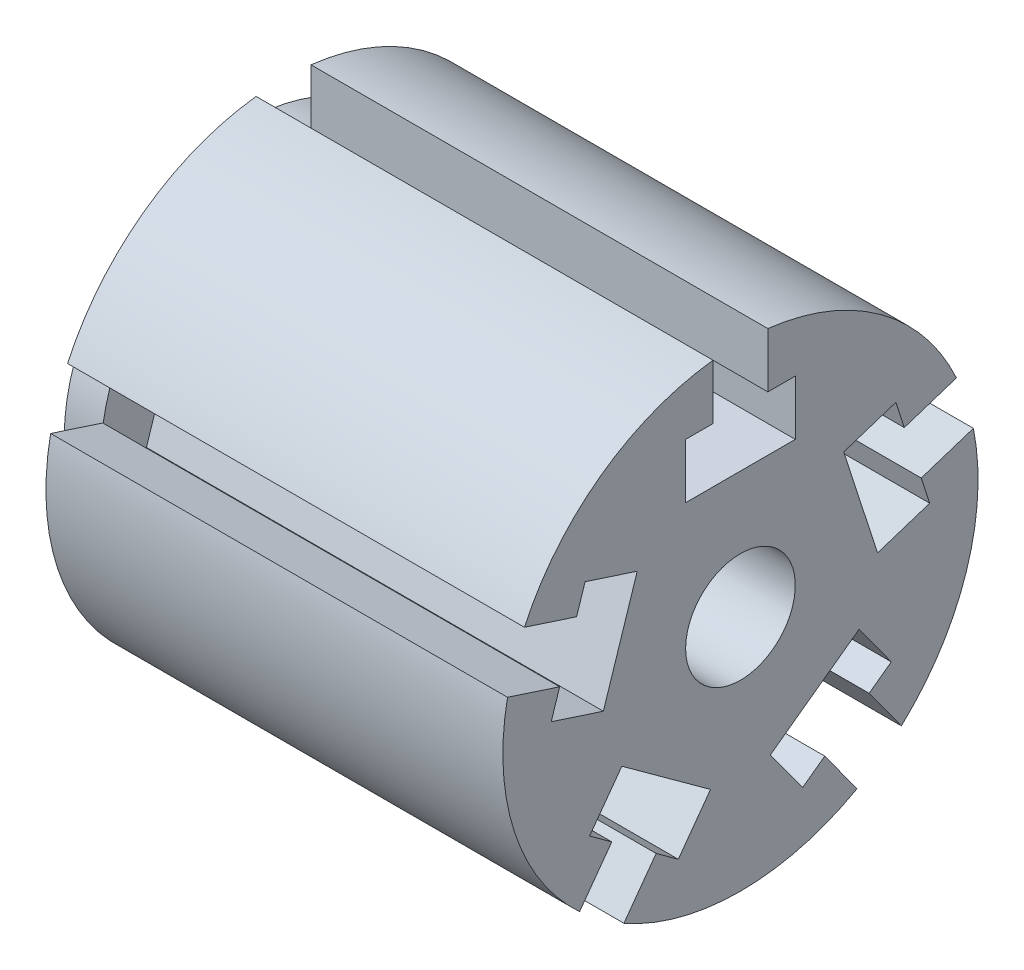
ISO-10303-21;
HEADER;
FILE_DESCRIPTION(('STEP AP214'),'2;1');
FILE_NAME('part.step','',(''),(''),'','','');
FILE_SCHEMA(('AUTOMOTIVE_DESIGN { 1 0 10303 214 1 1 1 1 }'));
ENDSEC;
DATA;
#1=APPLICATION_CONTEXT('core data for automotive mechanical design processes');
#2=APPLICATION_PROTOCOL_DEFINITION('international standard','automotive_design',2000,#1);
#3=PRODUCT_CONTEXT('',#1,'mechanical');
#4=PRODUCT('Part','Part','',(#3));
#5=PRODUCT_RELATED_PRODUCT_CATEGORY('part','',(#4));
#6=PRODUCT_DEFINITION_FORMATION('','',#4);
#7=PRODUCT_DEFINITION_CONTEXT('part definition',#1,'design');
#8=PRODUCT_DEFINITION('design','',#6,#7);
#9=PRODUCT_DEFINITION_SHAPE('','',#8);
#10=(LENGTH_UNIT() NAMED_UNIT(*) SI_UNIT(.MILLI.,.METRE.));
#11=(NAMED_UNIT(*) PLANE_ANGLE_UNIT() SI_UNIT($,.RADIAN.));
#12=(NAMED_UNIT(*) SI_UNIT($,.STERADIAN.) SOLID_ANGLE_UNIT());
#13=UNCERTAINTY_MEASURE_WITH_UNIT(LENGTH_MEASURE(1.E-05),#10,'distance_accuracy_value','');
#14=(GEOMETRIC_REPRESENTATION_CONTEXT(3) GLOBAL_UNCERTAINTY_ASSIGNED_CONTEXT((#13)) GLOBAL_UNIT_ASSIGNED_CONTEXT((#10,
#11,#12)) REPRESENTATION_CONTEXT('',''));
#15=CARTESIAN_POINT('',(0.,0.,0.));
#16=DIRECTION('',(0.,0.,1.));
#17=DIRECTION('',(1.,0.,0.));
#18=AXIS2_PLACEMENT_3D('',#15,#16,#17);
#19=CARTESIAN_POINT('',(25.,0.,0.));
#20=DIRECTION('',(-1.,0.,0.));
#21=DIRECTION('',(0.,0.,1.));
#22=AXIS2_PLACEMENT_3D('',#19,#20,#21);
#23=CYLINDRICAL_SURFACE('',#22,13.);
#24=CARTESIAN_POINT('',(0.,0.,0.));
#25=DIRECTION('',(1.,0.,0.));
#26=DIRECTION('',(0.,0.,-1.));
#27=AXIS2_PLACEMENT_3D('',#24,#25,#26);
#28=CIRCLE('',#27,13.);
#29=CARTESIAN_POINT('',(0.,-9.56529737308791,-8.80369730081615));
#30=VERTEX_POINT('',#29);
#31=CARTESIAN_POINT('',(0.,2.56380469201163,-12.7446814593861));
#32=VERTEX_POINT('',#31);
#33=EDGE_CURVE('E775',#30,#32,#28,.T.);
#34=ORIENTED_EDGE('',*,*,#33,.T.);
#35=DIRECTION('',(1.,0.,0.));
#36=VECTOR('',#35,1.);
#37=CARTESIAN_POINT('',(-9.71432316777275,2.56380469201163,-12.7446814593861));
#38=LINE('',#37,#36);
#39=CARTESIAN_POINT('',(25.,2.56380469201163,-12.7446814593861));
#40=VERTEX_POINT('',#39);
#41=EDGE_CURVE('E572',#32,#40,#38,.T.);
#42=ORIENTED_EDGE('',*,*,#41,.T.);
#43=CARTESIAN_POINT('',(25.,0.,0.));
#44=DIRECTION('',(1.,0.,0.));
#45=DIRECTION('',(0.,0.,-1.));
#46=AXIS2_PLACEMENT_3D('',#43,#44,#45);
#47=CIRCLE('',#46,13.);
#48=CARTESIAN_POINT('',(25.,-9.56529737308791,-8.80369730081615));
#49=VERTEX_POINT('',#48);
#50=EDGE_CURVE('E370',#49,#40,#47,.T.);
#51=ORIENTED_EDGE('',*,*,#50,.F.);
#52=DIRECTION('',(1.,0.,0.));
#53=VECTOR('',#52,1.);
#54=CARTESIAN_POINT('',(-10.3733818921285,-9.56529737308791,-8.80369730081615));
#55=LINE('',#54,#53);
#56=EDGE_CURVE('E625',#30,#49,#55,.T.);
#57=ORIENTED_EDGE('',*,*,#56,.F.);
#58=EDGE_LOOP('',(#34,#42,#51,#57));
#59=FACE_BOUND('',#58,.T.);
#60=ADVANCED_FACE('F43',(#59),#23,.T.);
#61=CARTESIAN_POINT('',(0.,-11.3286531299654,6.37664631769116));
#62=VERTEX_POINT('',#61);
#63=CARTESIAN_POINT('',(0.,-11.3286531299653,-6.37664631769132));
#64=VERTEX_POINT('',#63);
#65=EDGE_CURVE('E772',#62,#64,#28,.T.);
#66=ORIENTED_EDGE('',*,*,#65,.T.);
#67=DIRECTION('',(1.,0.,0.));
#68=VECTOR('',#67,1.);
#69=CARTESIAN_POINT('',(-10.3733818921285,-11.3286531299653,-6.37664631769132));
#70=LINE('',#69,#68);
#71=CARTESIAN_POINT('',(25.,-11.3286531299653,-6.37664631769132));
#72=VERTEX_POINT('',#71);
#73=EDGE_CURVE('E367',#64,#72,#70,.T.);
#74=ORIENTED_EDGE('',*,*,#73,.T.);
#75=CARTESIAN_POINT('',(25.,-11.3286531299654,6.37664631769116));
#76=VERTEX_POINT('',#75);
#77=EDGE_CURVE('E358',#76,#72,#47,.T.);
#78=ORIENTED_EDGE('',*,*,#77,.F.);
#79=DIRECTION('',(1.,0.,0.));
#80=VECTOR('',#79,1.);
#81=CARTESIAN_POINT('',(-10.3733818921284,-11.3286531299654,6.37664631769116));
#82=LINE('',#81,#80);
#83=EDGE_CURVE('E336',#62,#76,#82,.T.);
#84=ORIENTED_EDGE('',*,*,#83,.F.);
#85=EDGE_LOOP('',(#66,#74,#78,#84));
#86=FACE_BOUND('',#85,.T.);
#87=ADVANCED_FACE('F366',(#86),#23,.T.);
#88=CARTESIAN_POINT('',(0.,2.56380469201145,12.7446814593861));
#89=VERTEX_POINT('',#88);
#90=CARTESIAN_POINT('',(0.,-9.56529737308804,8.80369730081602));
#91=VERTEX_POINT('',#90);
#92=EDGE_CURVE('E774',#89,#91,#28,.T.);
#93=ORIENTED_EDGE('',*,*,#92,.T.);
#94=DIRECTION('',(1.,0.,0.));
#95=VECTOR('',#94,1.);
#96=CARTESIAN_POINT('',(-10.3733818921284,-9.56529737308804,8.80369730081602));
#97=LINE('',#96,#95);
#98=CARTESIAN_POINT('',(25.,-9.56529737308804,8.80369730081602));
#99=VERTEX_POINT('',#98);
#100=EDGE_CURVE('E714',#91,#99,#97,.T.);
#101=ORIENTED_EDGE('',*,*,#100,.T.);
#102=CARTESIAN_POINT('',(25.,2.56380469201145,12.7446814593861));
#103=VERTEX_POINT('',#102);
#104=EDGE_CURVE('E369',#103,#99,#47,.T.);
#105=ORIENTED_EDGE('',*,*,#104,.F.);
#106=DIRECTION('',(1.,0.,0.));
#107=VECTOR('',#106,1.);
#108=CARTESIAN_POINT('',(-9.71432316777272,2.56380469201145,12.7446814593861));
#109=LINE('',#108,#107);
#110=EDGE_CURVE('E474',#89,#103,#109,.T.);
#111=ORIENTED_EDGE('',*,*,#110,.F.);
#112=EDGE_LOOP('',(#93,#101,#105,#111));
#113=FACE_BOUND('',#112,.T.);
#114=ADVANCED_FACE('F817',(#113),#23,.T.);
#115=CARTESIAN_POINT('',(0.,12.913171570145,1.5));
#116=VERTEX_POINT('',#115);
#117=CARTESIAN_POINT('',(0.,5.41697424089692,11.8176304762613));
#118=VERTEX_POINT('',#117);
#119=EDGE_CURVE('E47',#116,#118,#28,.T.);
#120=ORIENTED_EDGE('',*,*,#119,.T.);
#121=DIRECTION('',(1.,0.,0.));
#122=VECTOR('',#121,1.);
#123=CARTESIAN_POINT('',(-9.71432316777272,5.41697424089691,11.8176304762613));
#124=LINE('',#123,#122);
#125=CARTESIAN_POINT('',(25.,5.41697424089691,11.8176304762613));
#126=VERTEX_POINT('',#125);
#127=EDGE_CURVE('E496',#118,#126,#124,.T.);
#128=ORIENTED_EDGE('',*,*,#127,.T.);
#129=CARTESIAN_POINT('',(25.,12.913171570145,1.5));
#130=VERTEX_POINT('',#129);
#131=EDGE_CURVE('E374',#130,#126,#47,.T.);
#132=ORIENTED_EDGE('',*,*,#131,.F.);
#133=DIRECTION('',(1.,0.,0.));
#134=VECTOR('',#133,1.);
#135=CARTESIAN_POINT('',(-8.54689887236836,12.913171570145,1.5));
#136=LINE('',#135,#134);
#137=EDGE_CURVE('E397',#116,#130,#136,.T.);
#138=ORIENTED_EDGE('',*,*,#137,.F.);
#139=EDGE_LOOP('',(#120,#128,#132,#138));
#140=FACE_BOUND('',#139,.T.);
#141=ADVANCED_FACE('F805',(#140),#23,.T.);
#142=CARTESIAN_POINT('',(0.,0.,0.));
#143=DIRECTION('',(1.,0.,0.));
#144=DIRECTION('',(0.,0.,-1.));
#145=AXIS2_PLACEMENT_3D('',#142,#143,#144);
#146=PLANE('',#145);
#147=DIRECTION('',(0.,-0.95105651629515,-0.309016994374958));
#148=VECTOR('',#147,1.);
#149=CARTESIAN_POINT('',(0.,0.21016893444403,-10.3550374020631));
#150=LINE('',#149,#148);
#151=CARTESIAN_POINT('',(0.,1.63675370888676,-9.89151191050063));
#152=VERTEX_POINT('',#151);
#153=CARTESIAN_POINT('',(0.,0.21016893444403,-10.3550374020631));
#154=VERTEX_POINT('',#153);
#155=EDGE_CURVE('E605',#152,#154,#150,.T.);
#156=ORIENTED_EDGE('',*,*,#155,.F.);
#157=DIRECTION('',(0.,-0.309016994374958,0.95105651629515));
#158=VECTOR('',#157,1.);
#159=CARTESIAN_POINT('',(0.,1.63675370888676,-9.89151191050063));
#160=LINE('',#159,#158);
#161=EDGE_CURVE('E549',#32,#152,#160,.T.);
#162=ORIENTED_EDGE('',*,*,#161,.F.);
#163=ORIENTED_EDGE('',*,*,#33,.F.);
#164=DIRECTION('',(0.,-0.809016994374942,-0.58778525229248));
#165=VECTOR('',#164,1.);
#166=CARTESIAN_POINT('',(0.,-9.56529737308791,-8.80369730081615));
#167=LINE('',#166,#165);
#168=CARTESIAN_POINT('',(0.,-7.13824638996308,-7.04034154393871));
#169=VERTEX_POINT('',#168);
#170=EDGE_CURVE('E363',#169,#30,#167,.T.);
#171=ORIENTED_EDGE('',*,*,#170,.F.);
#172=DIRECTION('',(0.,-0.58778525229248,0.809016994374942));
#173=VECTOR('',#172,1.);
#174=CARTESIAN_POINT('',(0.,-7.13824638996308,-7.04034154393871));
#175=LINE('',#174,#173);
#176=CARTESIAN_POINT('',(0.,-6.25656851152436,-8.25386703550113));
#177=VERTEX_POINT('',#176);
#178=EDGE_CURVE('E649',#177,#169,#175,.T.);
#179=ORIENTED_EDGE('',*,*,#178,.F.);
#180=DIRECTION('',(0.,-0.809016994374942,-0.58778525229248));
#181=VECTOR('',#180,1.);
#182=CARTESIAN_POINT('',(0.,-6.25656851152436,-8.25386703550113));
#183=LINE('',#182,#181);
#184=CARTESIAN_POINT('',(0.,-5.95417449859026,-8.03416492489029));
#185=VERTEX_POINT('',#184);
#186=EDGE_CURVE('E691',#185,#177,#183,.T.);
#187=ORIENTED_EDGE('',*,*,#186,.F.);
#188=CARTESIAN_POINT('',(0.,0.,0.));
#189=DIRECTION('',(-1.,0.,0.));
#190=DIRECTION('',(0.,0.,1.));
#191=AXIS2_PLACEMENT_3D('',#188,#189,#190);
#192=CIRCLE('',#191,10.);
#193=CARTESIAN_POINT('',(0.,0.0946646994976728,-9.99955191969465));
#194=VERTEX_POINT('',#193);
#195=EDGE_CURVE('E1072',#194,#185,#192,.T.);
#196=ORIENTED_EDGE('',*,*,#195,.F.);
#197=DIRECTION('',(0.,-0.309016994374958,0.95105651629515));
#198=VECTOR('',#197,1.);
#199=CARTESIAN_POINT('',(0.,-0.716882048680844,-7.50186785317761));
#200=LINE('',#199,#198);
#201=EDGE_CURVE('E608',#154,#194,#200,.T.);
#202=ORIENTED_EDGE('',*,*,#201,.F.);
#203=EDGE_LOOP('',(#156,#162,#163,#171,#179,#187,#196,#202));
#204=FACE_BOUND('',#203,.T.);
#205=ADVANCED_FACE('F816',(#204),#146,.F.);
#206=DIRECTION('',(0.,-0.58778525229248,0.809016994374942));
#207=VECTOR('',#206,1.);
#208=CARTESIAN_POINT('',(0.,-9.78328002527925,-3.39976506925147));
#209=LINE('',#208,#207);
#210=CARTESIAN_POINT('',(0.,-8.90160214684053,-4.61329056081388));
#211=VERTEX_POINT('',#210);
#212=CARTESIAN_POINT('',(0.,-9.78328002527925,-3.39976506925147));
#213=VERTEX_POINT('',#212);
#214=EDGE_CURVE('E677',#211,#213,#209,.T.);
#215=ORIENTED_EDGE('',*,*,#214,.F.);
#216=DIRECTION('',(0.,0.809016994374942,0.58778525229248));
#217=VECTOR('',#216,1.);
#218=CARTESIAN_POINT('',(0.,-8.90160214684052,-4.61329056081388));
#219=LINE('',#218,#217);
#220=EDGE_CURVE('E624',#64,#211,#219,.T.);
#221=ORIENTED_EDGE('',*,*,#220,.F.);
#222=ORIENTED_EDGE('',*,*,#65,.F.);
#223=DIRECTION('',(0.,-0.809016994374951,0.587785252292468));
#224=VECTOR('',#223,1.);
#225=CARTESIAN_POINT('',(0.,-11.3286531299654,6.37664631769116));
#226=LINE('',#225,#224);
#227=CARTESIAN_POINT('',(0.,-8.90160214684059,4.61329056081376));
#228=VERTEX_POINT('',#227);
#229=EDGE_CURVE('E343',#228,#62,#226,.T.);
#230=ORIENTED_EDGE('',*,*,#229,.F.);
#231=DIRECTION('',(0.,0.587785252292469,0.809016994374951));
#232=VECTOR('',#231,1.);
#233=CARTESIAN_POINT('',(0.,-8.90160214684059,4.61329056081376));
#234=LINE('',#233,#232);
#235=CARTESIAN_POINT('',(0.,-9.78328002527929,3.39976506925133));
#236=VERTEX_POINT('',#235);
#237=EDGE_CURVE('E718',#236,#228,#234,.T.);
#238=ORIENTED_EDGE('',*,*,#237,.F.);
#239=DIRECTION('',(0.,-0.809016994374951,0.587785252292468));
#240=VECTOR('',#239,1.);
#241=CARTESIAN_POINT('',(0.,-9.78328002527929,3.39976506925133));
#242=LINE('',#241,#240);
#243=CARTESIAN_POINT('',(0.,-9.48088601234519,3.1800629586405));
#244=VERTEX_POINT('',#243);
#245=EDGE_CURVE('E754',#244,#236,#242,.T.);
#246=ORIENTED_EDGE('',*,*,#245,.F.);
#247=CARTESIAN_POINT('',(0.,-9.48088601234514,-3.18006295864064));
#248=VERTEX_POINT('',#247);
#249=EDGE_CURVE('E867',#248,#244,#192,.T.);
#250=ORIENTED_EDGE('',*,*,#249,.F.);
#251=DIRECTION('',(0.,0.809016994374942,0.58778525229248));
#252=VECTOR('',#251,1.);
#253=CARTESIAN_POINT('',(0.,-7.35622904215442,-1.63640931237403));
#254=LINE('',#253,#252);
#255=EDGE_CURVE('E680',#213,#248,#254,.T.);
#256=ORIENTED_EDGE('',*,*,#255,.F.);
#257=EDGE_LOOP('',(#215,#221,#222,#230,#238,#246,#250,#256));
#258=FACE_BOUND('',#257,.T.);
#259=ADVANCED_FACE('F770',(#258),#146,.F.);
#260=DIRECTION('',(0.,0.587785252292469,0.809016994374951));
#261=VECTOR('',#260,1.);
#262=CARTESIAN_POINT('',(0.,-6.25656851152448,8.25386703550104));
#263=LINE('',#262,#261);
#264=CARTESIAN_POINT('',(0.,-7.13824638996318,7.04034154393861));
#265=VERTEX_POINT('',#264);
#266=CARTESIAN_POINT('',(0.,-6.25656851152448,8.25386703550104));
#267=VERTEX_POINT('',#266);
#268=EDGE_CURVE('E741',#265,#267,#263,.T.);
#269=ORIENTED_EDGE('',*,*,#268,.F.);
#270=DIRECTION('',(0.,0.809016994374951,-0.587785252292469));
#271=VECTOR('',#270,1.);
#272=CARTESIAN_POINT('',(0.,-7.13824638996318,7.04034154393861));
#273=LINE('',#272,#271);
#274=EDGE_CURVE('E695',#91,#265,#273,.T.);
#275=ORIENTED_EDGE('',*,*,#274,.F.);
#276=ORIENTED_EDGE('',*,*,#92,.F.);
#277=DIRECTION('',(0.,0.309016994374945,0.951056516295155));
#278=VECTOR('',#277,1.);
#279=CARTESIAN_POINT('',(0.,2.56380469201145,12.7446814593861));
#280=LINE('',#279,#278);
#281=CARTESIAN_POINT('',(0.,1.63675370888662,9.89151191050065));
#282=VERTEX_POINT('',#281);
#283=EDGE_CURVE('E451',#282,#89,#280,.T.);
#284=ORIENTED_EDGE('',*,*,#283,.F.);
#285=DIRECTION('',(0.,0.951056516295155,-0.309016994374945));
#286=VECTOR('',#285,1.);
#287=CARTESIAN_POINT('',(0.,1.63675370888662,9.89151191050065));
#288=LINE('',#287,#286);
#289=CARTESIAN_POINT('',(0.,0.210168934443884,10.3550374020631));
#290=VERTEX_POINT('',#289);
#291=EDGE_CURVE('E500',#290,#282,#288,.T.);
#292=ORIENTED_EDGE('',*,*,#291,.F.);
#293=DIRECTION('',(0.,0.309016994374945,0.951056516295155));
#294=VECTOR('',#293,1.);
#295=CARTESIAN_POINT('',(0.,0.210168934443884,10.3550374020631));
#296=LINE('',#295,#294);
#297=CARTESIAN_POINT('',(0.,0.0946646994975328,9.99955191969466));
#298=VERTEX_POINT('',#297);
#299=EDGE_CURVE('E542',#298,#290,#296,.T.);
#300=ORIENTED_EDGE('',*,*,#299,.F.);
#301=CARTESIAN_POINT('',(0.,-5.95417449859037,8.03416492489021));
#302=VERTEX_POINT('',#301);
#303=EDGE_CURVE('E855',#302,#298,#192,.T.);
#304=ORIENTED_EDGE('',*,*,#303,.F.);
#305=DIRECTION('',(0.,0.809016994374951,-0.587785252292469));
#306=VECTOR('',#305,1.);
#307=CARTESIAN_POINT('',(0.,-3.82951752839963,6.49051127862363));
#308=LINE('',#307,#306);
#309=EDGE_CURVE('E70',#267,#302,#308,.T.);
#310=ORIENTED_EDGE('',*,*,#309,.F.);
#311=EDGE_LOOP('',(#269,#275,#276,#284,#292,#300,#304,#310));
#312=FACE_BOUND('',#311,.T.);
#313=ADVANCED_FACE('F812',(#312),#146,.F.);
#314=DIRECTION('',(0.,0.951056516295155,-0.309016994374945));
#315=VECTOR('',#314,1.);
#316=CARTESIAN_POINT('',(0.,5.91650803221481,8.5009354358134));
#317=LINE('',#316,#315);
#318=CARTESIAN_POINT('',(0.,4.48992325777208,8.96446092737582));
#319=VERTEX_POINT('',#318);
#320=CARTESIAN_POINT('',(0.,5.91650803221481,8.5009354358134));
#321=VERTEX_POINT('',#320);
#322=EDGE_CURVE('E529',#319,#321,#317,.T.);
#323=ORIENTED_EDGE('',*,*,#322,.F.);
#324=DIRECTION('',(0.,-0.309016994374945,-0.951056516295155));
#325=VECTOR('',#324,1.);
#326=CARTESIAN_POINT('',(0.,4.48992325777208,8.96446092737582));
#327=LINE('',#326,#325);
#328=EDGE_CURVE('E473',#118,#319,#327,.T.);
#329=ORIENTED_EDGE('',*,*,#328,.F.);
#330=ORIENTED_EDGE('',*,*,#119,.F.);
#331=DIRECTION('',(0.,1.,0.));
#332=VECTOR('',#331,1.);
#333=CARTESIAN_POINT('',(0.,12.913171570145,1.5));
#334=LINE('',#333,#332);
#335=CARTESIAN_POINT('',(0.,9.91317157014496,1.5));
#336=VERTEX_POINT('',#335);
#337=EDGE_CURVE('E390',#336,#116,#334,.T.);
#338=ORIENTED_EDGE('',*,*,#337,.F.);
#339=DIRECTION('',(0.,0.,-1.));
#340=VECTOR('',#339,1.);
#341=CARTESIAN_POINT('',(0.,9.91317157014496,1.5));
#342=LINE('',#341,#340);
#343=CARTESIAN_POINT('',(0.,9.91317157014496,3.));
#344=VERTEX_POINT('',#343);
#345=EDGE_CURVE('E423',#344,#336,#342,.T.);
#346=ORIENTED_EDGE('',*,*,#345,.F.);
#347=DIRECTION('',(0.,1.,0.));
#348=VECTOR('',#347,1.);
#349=CARTESIAN_POINT('',(0.,9.91317157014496,3.));
#350=LINE('',#349,#348);
#351=CARTESIAN_POINT('',(0.,9.53939201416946,3.));
#352=VERTEX_POINT('',#351);
#353=EDGE_CURVE('E468',#352,#344,#350,.T.);
#354=ORIENTED_EDGE('',*,*,#353,.F.);
#355=CARTESIAN_POINT('',(0.,5.80100379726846,8.14544995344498));
#356=VERTEX_POINT('',#355);
#357=EDGE_CURVE('E55',#356,#352,#192,.T.);
#358=ORIENTED_EDGE('',*,*,#357,.F.);
#359=DIRECTION('',(0.,-0.309016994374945,-0.951056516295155));
#360=VECTOR('',#359,1.);
#361=CARTESIAN_POINT('',(0.,4.98945704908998,5.64776588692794));
#362=LINE('',#361,#360);
#363=EDGE_CURVE('E62',#321,#356,#362,.T.);
#364=ORIENTED_EDGE('',*,*,#363,.F.);
#365=EDGE_LOOP('',(#323,#329,#330,#338,#346,#354,#358,#364));
#366=FACE_BOUND('',#365,.T.);
#367=ADVANCED_FACE('F804',(#366),#146,.F.);
#368=CARTESIAN_POINT('',(25.,5.41697424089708,-11.8176304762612));
#369=VERTEX_POINT('',#368);
#370=CARTESIAN_POINT('',(25.,12.913171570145,-1.5));
#371=VERTEX_POINT('',#370);
#372=EDGE_CURVE('E376',#369,#371,#47,.T.);
#373=ORIENTED_EDGE('',*,*,#372,.F.);
#374=DIRECTION('',(1.,0.,0.));
#375=VECTOR('',#374,1.);
#376=CARTESIAN_POINT('',(-9.71432316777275,5.41697424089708,-11.8176304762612));
#377=LINE('',#376,#375);
#378=CARTESIAN_POINT('',(0.,5.41697424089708,-11.8176304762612));
#379=VERTEX_POINT('',#378);
#380=EDGE_CURVE('E550',#379,#369,#377,.T.);
#381=ORIENTED_EDGE('',*,*,#380,.F.);
#382=CARTESIAN_POINT('',(0.,12.913171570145,-1.5));
#383=VERTEX_POINT('',#382);
#384=EDGE_CURVE('E384',#379,#383,#28,.T.);
#385=ORIENTED_EDGE('',*,*,#384,.T.);
#386=DIRECTION('',(1.,0.,0.));
#387=VECTOR('',#386,1.);
#388=CARTESIAN_POINT('',(-8.54689887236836,12.913171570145,-1.5));
#389=LINE('',#388,#387);
#390=EDGE_CURVE('E419',#383,#371,#389,.T.);
#391=ORIENTED_EDGE('',*,*,#390,.T.);
#392=EDGE_LOOP('',(#373,#381,#385,#391));
#393=FACE_BOUND('',#392,.T.);
#394=ADVANCED_FACE('F45',(#393),#23,.T.);
#395=CARTESIAN_POINT('',(25.,0.,0.));
#396=DIRECTION('',(1.,0.,0.));
#397=DIRECTION('',(0.,0.,-1.));
#398=AXIS2_PLACEMENT_3D('',#395,#396,#397);
#399=PLANE('',#398);
#400=DIRECTION('',(0.,0.309016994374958,-0.95105651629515));
#401=VECTOR('',#400,1.);
#402=CARTESIAN_POINT('',(25.,1.63675370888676,-9.89151191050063));
#403=LINE('',#402,#401);
#404=CARTESIAN_POINT('',(25.,1.63675370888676,-9.89151191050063));
#405=VERTEX_POINT('',#404);
#406=EDGE_CURVE('E554',#405,#40,#403,.T.);
#407=ORIENTED_EDGE('',*,*,#406,.F.);
#408=DIRECTION('',(0.,0.95105651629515,0.309016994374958));
#409=VECTOR('',#408,1.);
#410=CARTESIAN_POINT('',(25.,0.21016893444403,-10.3550374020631));
#411=LINE('',#410,#409);
#412=CARTESIAN_POINT('',(25.,0.21016893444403,-10.3550374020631));
#413=VERTEX_POINT('',#412);
#414=EDGE_CURVE('E579',#413,#405,#411,.T.);
#415=ORIENTED_EDGE('',*,*,#414,.F.);
#416=DIRECTION('',(0.,0.309016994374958,-0.95105651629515));
#417=VECTOR('',#416,1.);
#418=CARTESIAN_POINT('',(25.,-0.716882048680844,-7.50186785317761));
#419=LINE('',#418,#417);
#420=CARTESIAN_POINT('',(25.,-0.716882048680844,-7.50186785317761));
#421=VERTEX_POINT('',#420);
#422=EDGE_CURVE('E583',#421,#413,#419,.T.);
#423=ORIENTED_EDGE('',*,*,#422,.F.);
#424=DIRECTION('',(0.,-0.95105651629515,-0.309016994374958));
#425=VECTOR('',#424,1.);
#426=CARTESIAN_POINT('',(25.,4.98945704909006,-5.64776588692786));
#427=LINE('',#426,#425);
#428=CARTESIAN_POINT('',(25.,4.98945704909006,-5.64776588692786));
#429=VERTEX_POINT('',#428);
#430=EDGE_CURVE('E587',#429,#421,#427,.T.);
#431=ORIENTED_EDGE('',*,*,#430,.F.);
#432=DIRECTION('',(0.,-0.309016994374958,0.95105651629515));
#433=VECTOR('',#432,1.);
#434=CARTESIAN_POINT('',(25.,5.91650803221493,-8.50093543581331));
#435=LINE('',#434,#433);
#436=CARTESIAN_POINT('',(25.,5.91650803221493,-8.50093543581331));
#437=VERTEX_POINT('',#436);
#438=EDGE_CURVE('E591',#437,#429,#435,.T.);
#439=ORIENTED_EDGE('',*,*,#438,.F.);
#440=DIRECTION('',(0.,0.95105651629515,0.309016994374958));
#441=VECTOR('',#440,1.);
#442=CARTESIAN_POINT('',(25.,4.48992325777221,-8.96446092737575));
#443=LINE('',#442,#441);
#444=CARTESIAN_POINT('',(25.,4.48992325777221,-8.96446092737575));
#445=VERTEX_POINT('',#444);
#446=EDGE_CURVE('E595',#445,#437,#443,.T.);
#447=ORIENTED_EDGE('',*,*,#446,.F.);
#448=DIRECTION('',(0.,-0.309016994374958,0.95105651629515));
#449=VECTOR('',#448,1.);
#450=CARTESIAN_POINT('',(25.,5.41697424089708,-11.8176304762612));
#451=LINE('',#450,#449);
#452=EDGE_CURVE('E599',#369,#445,#451,.T.);
#453=ORIENTED_EDGE('',*,*,#452,.F.);
#454=ORIENTED_EDGE('',*,*,#372,.T.);
#455=DIRECTION('',(0.,1.,0.));
#456=VECTOR('',#455,1.);
#457=CARTESIAN_POINT('',(25.,9.91317157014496,-1.5));
#458=LINE('',#457,#456);
#459=CARTESIAN_POINT('',(25.,9.91317157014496,-1.5));
#460=VERTEX_POINT('',#459);
#461=EDGE_CURVE('E401',#460,#371,#458,.T.);
#462=ORIENTED_EDGE('',*,*,#461,.F.);
#463=DIRECTION('',(0.,0.,1.));
#464=VECTOR('',#463,1.);
#465=CARTESIAN_POINT('',(25.,9.91317157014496,-3.));
#466=LINE('',#465,#464);
#467=CARTESIAN_POINT('',(25.,9.91317157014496,-3.));
#468=VERTEX_POINT('',#467);
#469=EDGE_CURVE('E427',#468,#460,#466,.T.);
#470=ORIENTED_EDGE('',*,*,#469,.F.);
#471=DIRECTION('',(0.,1.,0.));
#472=VECTOR('',#471,1.);
#473=CARTESIAN_POINT('',(25.,6.91317157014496,-3.));
#474=LINE('',#473,#472);
#475=CARTESIAN_POINT('',(25.,6.91317157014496,-3.));
#476=VERTEX_POINT('',#475);
#477=EDGE_CURVE('E431',#476,#468,#474,.T.);
#478=ORIENTED_EDGE('',*,*,#477,.F.);
#479=DIRECTION('',(0.,0.,-1.));
#480=VECTOR('',#479,1.);
#481=CARTESIAN_POINT('',(25.,6.91317157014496,3.));
#482=LINE('',#481,#480);
#483=CARTESIAN_POINT('',(25.,6.91317157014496,3.));
#484=VERTEX_POINT('',#483);
#485=EDGE_CURVE('E435',#484,#476,#482,.T.);
#486=ORIENTED_EDGE('',*,*,#485,.F.);
#487=DIRECTION('',(0.,-1.,0.));
#488=VECTOR('',#487,1.);
#489=CARTESIAN_POINT('',(25.,9.91317157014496,3.));
#490=LINE('',#489,#488);
#491=CARTESIAN_POINT('',(25.,9.91317157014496,3.));
#492=VERTEX_POINT('',#491);
#493=EDGE_CURVE('E439',#492,#484,#490,.T.);
#494=ORIENTED_EDGE('',*,*,#493,.F.);
#495=DIRECTION('',(0.,0.,1.));
#496=VECTOR('',#495,1.);
#497=CARTESIAN_POINT('',(25.,9.91317157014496,1.5));
#498=LINE('',#497,#496);
#499=CARTESIAN_POINT('',(25.,9.91317157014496,1.5));
#500=VERTEX_POINT('',#499);
#501=EDGE_CURVE('E443',#500,#492,#498,.T.);
#502=ORIENTED_EDGE('',*,*,#501,.F.);
#503=DIRECTION('',(0.,-1.,0.));
#504=VECTOR('',#503,1.);
#505=CARTESIAN_POINT('',(25.,12.913171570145,1.5));
#506=LINE('',#505,#504);
#507=EDGE_CURVE('E447',#130,#500,#506,.T.);
#508=ORIENTED_EDGE('',*,*,#507,.F.);
#509=ORIENTED_EDGE('',*,*,#131,.T.);
#510=DIRECTION('',(0.,0.309016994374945,0.951056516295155));
#511=VECTOR('',#510,1.);
#512=CARTESIAN_POINT('',(25.,4.48992325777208,8.96446092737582));
#513=LINE('',#512,#511);
#514=CARTESIAN_POINT('',(25.,4.48992325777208,8.96446092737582));
#515=VERTEX_POINT('',#514);
#516=EDGE_CURVE('E478',#515,#126,#513,.T.);
#517=ORIENTED_EDGE('',*,*,#516,.F.);
#518=DIRECTION('',(0.,-0.951056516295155,0.309016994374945));
#519=VECTOR('',#518,1.);
#520=CARTESIAN_POINT('',(25.,5.91650803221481,8.5009354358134));
#521=LINE('',#520,#519);
#522=CARTESIAN_POINT('',(25.,5.91650803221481,8.5009354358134));
#523=VERTEX_POINT('',#522);
#524=EDGE_CURVE('E503',#523,#515,#521,.T.);
#525=ORIENTED_EDGE('',*,*,#524,.F.);
#526=DIRECTION('',(0.,0.309016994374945,0.951056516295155));
#527=VECTOR('',#526,1.);
#528=CARTESIAN_POINT('',(25.,4.98945704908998,5.64776588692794));
#529=LINE('',#528,#527);
#530=CARTESIAN_POINT('',(25.,4.98945704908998,5.64776588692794));
#531=VERTEX_POINT('',#530);
#532=EDGE_CURVE('E507',#531,#523,#529,.T.);
#533=ORIENTED_EDGE('',*,*,#532,.F.);
#534=DIRECTION('',(0.,0.951056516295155,-0.309016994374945));
#535=VECTOR('',#534,1.);
#536=CARTESIAN_POINT('',(25.,-0.71688204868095,7.5018678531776));
#537=LINE('',#536,#535);
#538=CARTESIAN_POINT('',(25.,-0.71688204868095,7.5018678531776));
#539=VERTEX_POINT('',#538);
#540=EDGE_CURVE('E511',#539,#531,#537,.T.);
#541=ORIENTED_EDGE('',*,*,#540,.F.);
#542=DIRECTION('',(0.,-0.309016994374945,-0.951056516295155));
#543=VECTOR('',#542,1.);
#544=CARTESIAN_POINT('',(25.,0.210168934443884,10.3550374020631));
#545=LINE('',#544,#543);
#546=CARTESIAN_POINT('',(25.,0.210168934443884,10.3550374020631));
#547=VERTEX_POINT('',#546);
#548=EDGE_CURVE('E515',#547,#539,#545,.T.);
#549=ORIENTED_EDGE('',*,*,#548,.F.);
#550=DIRECTION('',(0.,-0.951056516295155,0.309016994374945));
#551=VECTOR('',#550,1.);
#552=CARTESIAN_POINT('',(25.,1.63675370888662,9.89151191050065));
#553=LINE('',#552,#551);
#554=CARTESIAN_POINT('',(25.,1.63675370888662,9.89151191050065));
#555=VERTEX_POINT('',#554);
#556=EDGE_CURVE('E519',#555,#547,#553,.T.);
#557=ORIENTED_EDGE('',*,*,#556,.F.);
#558=DIRECTION('',(0.,-0.309016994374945,-0.951056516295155));
#559=VECTOR('',#558,1.);
#560=CARTESIAN_POINT('',(25.,2.56380469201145,12.7446814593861));
#561=LINE('',#560,#559);
#562=EDGE_CURVE('E523',#103,#555,#561,.T.);
#563=ORIENTED_EDGE('',*,*,#562,.F.);
#564=ORIENTED_EDGE('',*,*,#104,.T.);
#565=DIRECTION('',(0.,-0.809016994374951,0.587785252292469));
#566=VECTOR('',#565,1.);
#567=CARTESIAN_POINT('',(25.,-7.13824638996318,7.04034154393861));
#568=LINE('',#567,#566);
#569=CARTESIAN_POINT('',(25.,-7.13824638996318,7.04034154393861));
#570=VERTEX_POINT('',#569);
#571=EDGE_CURVE('E350',#570,#99,#568,.T.);
#572=ORIENTED_EDGE('',*,*,#571,.F.);
#573=DIRECTION('',(0.,-0.587785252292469,-0.809016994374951));
#574=VECTOR('',#573,1.);
#575=CARTESIAN_POINT('',(25.,-6.25656851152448,8.25386703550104));
#576=LINE('',#575,#574);
#577=CARTESIAN_POINT('',(25.,-6.25656851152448,8.25386703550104));
#578=VERTEX_POINT('',#577);
#579=EDGE_CURVE('E721',#578,#570,#576,.T.);
#580=ORIENTED_EDGE('',*,*,#579,.F.);
#581=DIRECTION('',(0.,-0.809016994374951,0.587785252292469));
#582=VECTOR('',#581,1.);
#583=CARTESIAN_POINT('',(25.,-3.82951752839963,6.49051127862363));
#584=LINE('',#583,#582);
#585=CARTESIAN_POINT('',(25.,-3.82951752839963,6.49051127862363));
#586=VERTEX_POINT('',#585);
#587=EDGE_CURVE('E725',#586,#578,#584,.T.);
#588=ORIENTED_EDGE('',*,*,#587,.F.);
#589=DIRECTION('',(0.,0.587785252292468,0.809016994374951));
#590=VECTOR('',#589,1.);
#591=CARTESIAN_POINT('',(25.,-7.35622904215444,1.63640931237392));
#592=LINE('',#591,#590);
#593=CARTESIAN_POINT('',(25.,-7.35622904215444,1.63640931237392));
#594=VERTEX_POINT('',#593);
#595=EDGE_CURVE('E729',#594,#586,#592,.T.);
#596=ORIENTED_EDGE('',*,*,#595,.F.);
#597=DIRECTION('',(0.,0.809016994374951,-0.587785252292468));
#598=VECTOR('',#597,1.);
#599=CARTESIAN_POINT('',(25.,-9.78328002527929,3.39976506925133));
#600=LINE('',#599,#598);
#601=CARTESIAN_POINT('',(25.,-9.78328002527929,3.39976506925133));
#602=VERTEX_POINT('',#601);
#603=EDGE_CURVE('E733',#602,#594,#600,.T.);
#604=ORIENTED_EDGE('',*,*,#603,.F.);
#605=DIRECTION('',(0.,-0.587785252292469,-0.809016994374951));
#606=VECTOR('',#605,1.);
#607=CARTESIAN_POINT('',(25.,-8.90160214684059,4.61329056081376));
#608=LINE('',#607,#606);
#609=CARTESIAN_POINT('',(25.,-8.90160214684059,4.61329056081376));
#610=VERTEX_POINT('',#609);
#611=EDGE_CURVE('E361',#610,#602,#608,.T.);
#612=ORIENTED_EDGE('',*,*,#611,.F.);
#613=DIRECTION('',(0.,0.809016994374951,-0.587785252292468));
#614=VECTOR('',#613,1.);
#615=CARTESIAN_POINT('',(25.,-11.3286531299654,6.37664631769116));
#616=LINE('',#615,#614);
#617=EDGE_CURVE('E340',#76,#610,#616,.T.);
#618=ORIENTED_EDGE('',*,*,#617,.F.);
#619=ORIENTED_EDGE('',*,*,#77,.T.);
#620=DIRECTION('',(0.,-0.809016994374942,-0.58778525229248));
#621=VECTOR('',#620,1.);
#622=CARTESIAN_POINT('',(25.,-8.90160214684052,-4.61329056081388));
#623=LINE('',#622,#621);
#624=CARTESIAN_POINT('',(25.,-8.90160214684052,-4.61329056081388));
#625=VERTEX_POINT('',#624);
#626=EDGE_CURVE('E629',#625,#72,#623,.T.);
#627=ORIENTED_EDGE('',*,*,#626,.F.);
#628=DIRECTION('',(0.,0.58778525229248,-0.809016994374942));
#629=VECTOR('',#628,1.);
#630=CARTESIAN_POINT('',(25.,-9.78328002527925,-3.39976506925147));
#631=LINE('',#630,#629);
#632=CARTESIAN_POINT('',(25.,-9.78328002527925,-3.39976506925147));
#633=VERTEX_POINT('',#632);
#634=EDGE_CURVE('E652',#633,#625,#631,.T.);
#635=ORIENTED_EDGE('',*,*,#634,.F.);
#636=DIRECTION('',(0.,-0.809016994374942,-0.58778525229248));
#637=VECTOR('',#636,1.);
#638=CARTESIAN_POINT('',(25.,-7.35622904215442,-1.63640931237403));
#639=LINE('',#638,#637);
#640=CARTESIAN_POINT('',(25.,-7.35622904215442,-1.63640931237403));
#641=VERTEX_POINT('',#640);
#642=EDGE_CURVE('E656',#641,#633,#639,.T.);
#643=ORIENTED_EDGE('',*,*,#642,.F.);
#644=DIRECTION('',(0.,-0.58778525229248,0.809016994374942));
#645=VECTOR('',#644,1.);
#646=CARTESIAN_POINT('',(25.,-3.82951752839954,-6.49051127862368));
#647=LINE('',#646,#645);
#648=CARTESIAN_POINT('',(25.,-3.82951752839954,-6.49051127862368));
#649=VERTEX_POINT('',#648);
#650=EDGE_CURVE('E660',#649,#641,#647,.T.);
#651=ORIENTED_EDGE('',*,*,#650,.F.);
#652=DIRECTION('',(0.,0.809016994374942,0.58778525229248));
#653=VECTOR('',#652,1.);
#654=CARTESIAN_POINT('',(25.,-6.25656851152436,-8.25386703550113));
#655=LINE('',#654,#653);
#656=CARTESIAN_POINT('',(25.,-6.25656851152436,-8.25386703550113));
#657=VERTEX_POINT('',#656);
#658=EDGE_CURVE('E664',#657,#649,#655,.T.);
#659=ORIENTED_EDGE('',*,*,#658,.F.);
#660=DIRECTION('',(0.,0.58778525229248,-0.809016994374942));
#661=VECTOR('',#660,1.);
#662=CARTESIAN_POINT('',(25.,-7.13824638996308,-7.04034154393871));
#663=LINE('',#662,#661);
#664=CARTESIAN_POINT('',(25.,-7.13824638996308,-7.04034154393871));
#665=VERTEX_POINT('',#664);
#666=EDGE_CURVE('E668',#665,#657,#663,.T.);
#667=ORIENTED_EDGE('',*,*,#666,.F.);
#668=DIRECTION('',(0.,0.809016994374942,0.58778525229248));
#669=VECTOR('',#668,1.);
#670=CARTESIAN_POINT('',(25.,-9.56529737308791,-8.80369730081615));
#671=LINE('',#670,#669);
#672=EDGE_CURVE('E548',#49,#665,#671,.T.);
#673=ORIENTED_EDGE('',*,*,#672,.F.);
#674=ORIENTED_EDGE('',*,*,#50,.T.);
#675=EDGE_LOOP('',(#407,#415,#423,#431,#439,#447,#453,#454,#462,#470,#478,#486,#494,#502,#508,
#509,#517,#525,#533,#541,#549,#557,#563,#564,#572,#580,#588,#596,#604,#612,#618,#619,#627,#635,
#643,#651,#659,#667,#673,#674));
#676=FACE_BOUND('',#675,.T.);
#677=CARTESIAN_POINT('',(25.,0.,0.));
#678=DIRECTION('',(-1.,0.,0.));
#679=DIRECTION('',(0.,0.,1.));
#680=AXIS2_PLACEMENT_3D('',#677,#678,#679);
#681=CIRCLE('',#680,3.);
#682=CARTESIAN_POINT('',(25.,0.,3.));
#683=VERTEX_POINT('',#682);
#684=EDGE_CURVE('E385',#683,#683,#681,.T.);
#685=ORIENTED_EDGE('',*,*,#684,.T.);
#686=EDGE_LOOP('',(#685));
#687=FACE_BOUND('',#686,.T.);
#688=ADVANCED_FACE('F355',(#676,#687),#399,.T.);
#689=DIRECTION('',(0.,-0.95105651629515,-0.309016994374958));
#690=VECTOR('',#689,1.);
#691=CARTESIAN_POINT('',(0.,4.48992325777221,-8.96446092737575));
#692=LINE('',#691,#690);
#693=CARTESIAN_POINT('',(0.,5.91650803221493,-8.50093543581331));
#694=VERTEX_POINT('',#693);
#695=CARTESIAN_POINT('',(0.,4.48992325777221,-8.96446092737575));
#696=VERTEX_POINT('',#695);
#697=EDGE_CURVE('E576',#694,#696,#692,.T.);
#698=ORIENTED_EDGE('',*,*,#697,.F.);
#699=DIRECTION('',(0.,0.309016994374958,-0.95105651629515));
#700=VECTOR('',#699,1.);
#701=CARTESIAN_POINT('',(0.,5.91650803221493,-8.50093543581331));
#702=LINE('',#701,#700);
#703=CARTESIAN_POINT('',(0.,5.80100379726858,-8.1454499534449));
#704=VERTEX_POINT('',#703);
#705=EDGE_CURVE('E619',#704,#694,#702,.T.);
#706=ORIENTED_EDGE('',*,*,#705,.F.);
#707=CARTESIAN_POINT('',(0.,9.53939201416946,-3.));
#708=VERTEX_POINT('',#707);
#709=EDGE_CURVE('E53',#708,#704,#192,.T.);
#710=ORIENTED_EDGE('',*,*,#709,.F.);
#711=DIRECTION('',(0.,-1.,0.));
#712=VECTOR('',#711,1.);
#713=CARTESIAN_POINT('',(0.,6.91317157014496,-3.));
#714=LINE('',#713,#712);
#715=CARTESIAN_POINT('',(0.,9.91317157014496,-3.));
#716=VERTEX_POINT('',#715);
#717=EDGE_CURVE('E457',#716,#708,#714,.T.);
#718=ORIENTED_EDGE('',*,*,#717,.F.);
#719=DIRECTION('',(0.,0.,-1.));
#720=VECTOR('',#719,1.);
#721=CARTESIAN_POINT('',(0.,9.91317157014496,-3.));
#722=LINE('',#721,#720);
#723=CARTESIAN_POINT('',(0.,9.91317157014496,-1.5));
#724=VERTEX_POINT('',#723);
#725=EDGE_CURVE('E454',#724,#716,#722,.T.);
#726=ORIENTED_EDGE('',*,*,#725,.F.);
#727=DIRECTION('',(0.,-1.,0.));
#728=VECTOR('',#727,1.);
#729=CARTESIAN_POINT('',(0.,9.91317157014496,-1.5));
#730=LINE('',#729,#728);
#731=EDGE_CURVE('E396',#383,#724,#730,.T.);
#732=ORIENTED_EDGE('',*,*,#731,.F.);
#733=ORIENTED_EDGE('',*,*,#384,.F.);
#734=DIRECTION('',(0.,0.309016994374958,-0.95105651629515));
#735=VECTOR('',#734,1.);
#736=CARTESIAN_POINT('',(0.,5.41697424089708,-11.8176304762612));
#737=LINE('',#736,#735);
#738=EDGE_CURVE('E545',#696,#379,#737,.T.);
#739=ORIENTED_EDGE('',*,*,#738,.F.);
#740=EDGE_LOOP('',(#698,#706,#710,#718,#726,#732,#733,#739));
#741=FACE_BOUND('',#740,.T.);
#742=ADVANCED_FACE('F810',(#741),#146,.F.);
#743=CARTESIAN_POINT('',(-2.,0.,0.));
#744=DIRECTION('',(1.,0.,0.));
#745=DIRECTION('',(0.,0.,-1.));
#746=AXIS2_PLACEMENT_3D('',#743,#744,#745);
#747=CYLINDRICAL_SURFACE('',#746,10.);
#748=CARTESIAN_POINT('',(-2.,0.,0.));
#749=DIRECTION('',(-1.,0.,0.));
#750=DIRECTION('',(0.,0.,1.));
#751=AXIS2_PLACEMENT_3D('',#748,#749,#750);
#752=CIRCLE('',#751,10.);
#753=CARTESIAN_POINT('',(-2.,0.,10.));
#754=VERTEX_POINT('',#753);
#755=EDGE_CURVE('E380',#754,#754,#752,.T.);
#756=ORIENTED_EDGE('',*,*,#755,.F.);
#757=EDGE_LOOP('',(#756));
#758=FACE_BOUND('',#757,.T.);
#759=EDGE_CURVE('E11',#352,#708,#192,.T.);
#760=ORIENTED_EDGE('',*,*,#759,.T.);
#761=ORIENTED_EDGE('',*,*,#709,.T.);
#762=EDGE_CURVE('E1075',#704,#194,#192,.T.);
#763=ORIENTED_EDGE('',*,*,#762,.T.);
#764=ORIENTED_EDGE('',*,*,#195,.T.);
#765=EDGE_CURVE('E1068',#185,#248,#192,.T.);
#766=ORIENTED_EDGE('',*,*,#765,.T.);
#767=ORIENTED_EDGE('',*,*,#249,.T.);
#768=EDGE_CURVE('E863',#244,#302,#192,.T.);
#769=ORIENTED_EDGE('',*,*,#768,.T.);
#770=ORIENTED_EDGE('',*,*,#303,.T.);
#771=EDGE_CURVE('E862',#298,#356,#192,.T.);
#772=ORIENTED_EDGE('',*,*,#771,.T.);
#773=ORIENTED_EDGE('',*,*,#357,.T.);
#774=EDGE_LOOP('',(#760,#761,#763,#764,#766,#767,#769,#770,#772,#773));
#775=FACE_BOUND('',#774,.T.);
#776=ADVANCED_FACE('F861',(#758,#775),#747,.T.);
#777=CARTESIAN_POINT('',(-2.,0.,0.));
#778=DIRECTION('',(-1.,0.,0.));
#779=DIRECTION('',(0.,0.,1.));
#780=AXIS2_PLACEMENT_3D('',#777,#778,#779);
#781=PLANE('',#780);
#782=CARTESIAN_POINT('',(-2.,0.,0.));
#783=DIRECTION('',(-1.,0.,0.));
#784=DIRECTION('',(0.,0.,1.));
#785=AXIS2_PLACEMENT_3D('',#782,#783,#784);
#786=CIRCLE('',#785,3.);
#787=CARTESIAN_POINT('',(-2.,0.,3.));
#788=VERTEX_POINT('',#787);
#789=EDGE_CURVE('E386',#788,#788,#786,.T.);
#790=ORIENTED_EDGE('',*,*,#789,.F.);
#791=EDGE_LOOP('',(#790));
#792=FACE_BOUND('',#791,.T.);
#793=ORIENTED_EDGE('',*,*,#755,.T.);
#794=EDGE_LOOP('',(#793));
#795=FACE_BOUND('',#794,.T.);
#796=ADVANCED_FACE('F1030',(#792,#795),#781,.T.);
#797=CARTESIAN_POINT('',(25.,0.,0.));
#798=DIRECTION('',(-1.,0.,0.));
#799=DIRECTION('',(0.,0.,1.));
#800=AXIS2_PLACEMENT_3D('',#797,#798,#799);
#801=CYLINDRICAL_SURFACE('',#800,3.);
#802=ORIENTED_EDGE('',*,*,#684,.F.);
#803=EDGE_LOOP('',(#802));
#804=FACE_BOUND('',#803,.T.);
#805=ORIENTED_EDGE('',*,*,#789,.T.);
#806=EDGE_LOOP('',(#805));
#807=FACE_BOUND('',#806,.T.);
#808=ADVANCED_FACE('F1004',(#804,#807),#801,.F.);
#809=CARTESIAN_POINT('',(0.,0.,0.));
#810=DIRECTION('',(1.,0.,0.));
#811=DIRECTION('',(0.,0.,-1.));
#812=AXIS2_PLACEMENT_3D('',#809,#810,#811);
#813=PLANE('',#812);
#814=ORIENTED_EDGE('',*,*,#759,.F.);
#815=CARTESIAN_POINT('',(0.,6.91317157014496,3.));
#816=VERTEX_POINT('',#815);
#817=EDGE_CURVE('E464',#816,#352,#350,.T.);
#818=ORIENTED_EDGE('',*,*,#817,.F.);
#819=DIRECTION('',(0.,0.,1.));
#820=VECTOR('',#819,1.);
#821=CARTESIAN_POINT('',(0.,6.91317157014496,3.));
#822=LINE('',#821,#820);
#823=CARTESIAN_POINT('',(0.,6.91317157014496,-3.));
#824=VERTEX_POINT('',#823);
#825=EDGE_CURVE('E461',#824,#816,#822,.T.);
#826=ORIENTED_EDGE('',*,*,#825,.F.);
#827=EDGE_CURVE('E460',#708,#824,#714,.T.);
#828=ORIENTED_EDGE('',*,*,#827,.F.);
#829=EDGE_LOOP('',(#814,#818,#826,#828));
#830=FACE_BOUND('',#829,.T.);
#831=ADVANCED_FACE('F876',(#830),#813,.T.);
#832=CARTESIAN_POINT('',(-8.54689887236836,9.91317157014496,-1.5));
#833=DIRECTION('',(0.,0.,-1.));
#834=DIRECTION('',(-1.,0.,0.));
#835=AXIS2_PLACEMENT_3D('',#832,#833,#834);
#836=PLANE('',#835);
#837=ORIENTED_EDGE('',*,*,#731,.T.);
#838=DIRECTION('',(1.,0.,0.));
#839=VECTOR('',#838,1.);
#840=CARTESIAN_POINT('',(-8.54689887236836,9.91317157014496,-1.5));
#841=LINE('',#840,#839);
#842=EDGE_CURVE('E416',#724,#460,#841,.T.);
#843=ORIENTED_EDGE('',*,*,#842,.T.);
#844=ORIENTED_EDGE('',*,*,#461,.T.);
#845=ORIENTED_EDGE('',*,*,#390,.F.);
#846=EDGE_LOOP('',(#837,#843,#844,#845));
#847=FACE_BOUND('',#846,.T.);
#848=ADVANCED_FACE('F800',(#847),#836,.F.);
#849=CARTESIAN_POINT('',(-8.54689887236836,9.91317157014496,-3.));
#850=DIRECTION('',(0.,1.,0.));
#851=DIRECTION('',(0.,0.,1.));
#852=AXIS2_PLACEMENT_3D('',#849,#850,#851);
#853=PLANE('',#852);
#854=ORIENTED_EDGE('',*,*,#725,.T.);
#855=DIRECTION('',(1.,0.,0.));
#856=VECTOR('',#855,1.);
#857=CARTESIAN_POINT('',(-8.54689887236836,9.91317157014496,-3.));
#858=LINE('',#857,#856);
#859=EDGE_CURVE('E413',#716,#468,#858,.T.);
#860=ORIENTED_EDGE('',*,*,#859,.T.);
#861=ORIENTED_EDGE('',*,*,#469,.T.);
#862=ORIENTED_EDGE('',*,*,#842,.F.);
#863=EDGE_LOOP('',(#854,#860,#861,#862));
#864=FACE_BOUND('',#863,.T.);
#865=ADVANCED_FACE('F1007',(#864),#853,.F.);
#866=CARTESIAN_POINT('',(-8.54689887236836,6.91317157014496,-3.));
#867=DIRECTION('',(0.,0.,-1.));
#868=DIRECTION('',(0.,1.,0.));
#869=AXIS2_PLACEMENT_3D('',#866,#867,#868);
#870=PLANE('',#869);
#871=ORIENTED_EDGE('',*,*,#717,.T.);
#872=ORIENTED_EDGE('',*,*,#827,.T.);
#873=DIRECTION('',(1.,0.,0.));
#874=VECTOR('',#873,1.);
#875=CARTESIAN_POINT('',(-8.54689887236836,6.91317157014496,-3.));
#876=LINE('',#875,#874);
#877=EDGE_CURVE('E410',#824,#476,#876,.T.);
#878=ORIENTED_EDGE('',*,*,#877,.T.);
#879=ORIENTED_EDGE('',*,*,#477,.T.);
#880=ORIENTED_EDGE('',*,*,#859,.F.);
#881=EDGE_LOOP('',(#871,#872,#878,#879,#880));
#882=FACE_BOUND('',#881,.T.);
#883=ADVANCED_FACE('F1010',(#882),#870,.F.);
#884=CARTESIAN_POINT('',(-8.54689887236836,6.91317157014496,3.));
#885=DIRECTION('',(0.,-1.,0.));
#886=DIRECTION('',(0.,0.,-1.));
#887=AXIS2_PLACEMENT_3D('',#884,#885,#886);
#888=PLANE('',#887);
#889=ORIENTED_EDGE('',*,*,#825,.T.);
#890=DIRECTION('',(1.,0.,0.));
#891=VECTOR('',#890,1.);
#892=CARTESIAN_POINT('',(-8.54689887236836,6.91317157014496,3.));
#893=LINE('',#892,#891);
#894=EDGE_CURVE('E407',#816,#484,#893,.T.);
#895=ORIENTED_EDGE('',*,*,#894,.T.);
#896=ORIENTED_EDGE('',*,*,#485,.T.);
#897=ORIENTED_EDGE('',*,*,#877,.F.);
#898=EDGE_LOOP('',(#889,#895,#896,#897));
#899=FACE_BOUND('',#898,.T.);
#900=ADVANCED_FACE('F1014',(#899),#888,.F.);
#901=CARTESIAN_POINT('',(-8.54689887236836,9.91317157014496,3.));
#902=DIRECTION('',(0.,0.,1.));
#903=DIRECTION('',(0.,-1.,0.));
#904=AXIS2_PLACEMENT_3D('',#901,#902,#903);
#905=PLANE('',#904);
#906=ORIENTED_EDGE('',*,*,#817,.T.);
#907=ORIENTED_EDGE('',*,*,#353,.T.);
#908=DIRECTION('',(1.,0.,0.));
#909=VECTOR('',#908,1.);
#910=CARTESIAN_POINT('',(-8.54689887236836,9.91317157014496,3.));
#911=LINE('',#910,#909);
#912=EDGE_CURVE('E404',#344,#492,#911,.T.);
#913=ORIENTED_EDGE('',*,*,#912,.T.);
#914=ORIENTED_EDGE('',*,*,#493,.T.);
#915=ORIENTED_EDGE('',*,*,#894,.F.);
#916=EDGE_LOOP('',(#906,#907,#913,#914,#915));
#917=FACE_BOUND('',#916,.T.);
#918=ADVANCED_FACE('F881',(#917),#905,.F.);
#919=CARTESIAN_POINT('',(-8.54689887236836,9.91317157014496,1.5));
#920=DIRECTION('',(0.,1.,0.));
#921=DIRECTION('',(0.,0.,1.));
#922=AXIS2_PLACEMENT_3D('',#919,#920,#921);
#923=PLANE('',#922);
#924=ORIENTED_EDGE('',*,*,#345,.T.);
#925=DIRECTION('',(1.,0.,0.));
#926=VECTOR('',#925,1.);
#927=CARTESIAN_POINT('',(-8.54689887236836,9.91317157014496,1.5));
#928=LINE('',#927,#926);
#929=EDGE_CURVE('E400',#336,#500,#928,.T.);
#930=ORIENTED_EDGE('',*,*,#929,.T.);
#931=ORIENTED_EDGE('',*,*,#501,.T.);
#932=ORIENTED_EDGE('',*,*,#912,.F.);
#933=EDGE_LOOP('',(#924,#930,#931,#932));
#934=FACE_BOUND('',#933,.T.);
#935=ADVANCED_FACE('F1021',(#934),#923,.F.);
#936=CARTESIAN_POINT('',(-8.54689887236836,12.913171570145,1.5));
#937=DIRECTION('',(0.,0.,1.));
#938=DIRECTION('',(0.,-1.,0.));
#939=AXIS2_PLACEMENT_3D('',#936,#937,#938);
#940=PLANE('',#939);
#941=ORIENTED_EDGE('',*,*,#337,.T.);
#942=ORIENTED_EDGE('',*,*,#137,.T.);
#943=ORIENTED_EDGE('',*,*,#507,.T.);
#944=ORIENTED_EDGE('',*,*,#929,.F.);
#945=EDGE_LOOP('',(#941,#942,#943,#944));
#946=FACE_BOUND('',#945,.T.);
#947=ADVANCED_FACE('F979',(#946),#940,.F.);
#948=CARTESIAN_POINT('',(0.,0.,0.));
#949=DIRECTION('',(1.,0.,0.));
#950=DIRECTION('',(0.,0.,-1.));
#951=AXIS2_PLACEMENT_3D('',#948,#949,#950);
#952=PLANE('',#951);
#953=ORIENTED_EDGE('',*,*,#771,.F.);
#954=CARTESIAN_POINT('',(0.,-0.716882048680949,7.5018678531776));
#955=VERTEX_POINT('',#954);
#956=EDGE_CURVE('E538',#955,#298,#296,.T.);
#957=ORIENTED_EDGE('',*,*,#956,.F.);
#958=DIRECTION('',(0.,-0.951056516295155,0.309016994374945));
#959=VECTOR('',#958,1.);
#960=CARTESIAN_POINT('',(0.,-0.71688204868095,7.5018678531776));
#961=LINE('',#960,#959);
#962=CARTESIAN_POINT('',(0.,4.98945704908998,5.64776588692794));
#963=VERTEX_POINT('',#962);
#964=EDGE_CURVE('E535',#963,#955,#961,.T.);
#965=ORIENTED_EDGE('',*,*,#964,.F.);
#966=EDGE_CURVE('E534',#356,#963,#362,.T.);
#967=ORIENTED_EDGE('',*,*,#966,.F.);
#968=EDGE_LOOP('',(#953,#957,#965,#967));
#969=FACE_BOUND('',#968,.T.);
#970=ADVANCED_FACE('F975',(#969),#952,.T.);
#971=CARTESIAN_POINT('',(-9.71432316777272,4.48992325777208,8.96446092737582));
#972=DIRECTION('',(0.,0.951056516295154,-0.309016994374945));
#973=DIRECTION('',(0.,0.309016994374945,0.951056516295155));
#974=AXIS2_PLACEMENT_3D('',#971,#972,#973);
#975=PLANE('',#974);
#976=ORIENTED_EDGE('',*,*,#328,.T.);
#977=DIRECTION('',(1.,0.,0.));
#978=VECTOR('',#977,1.);
#979=CARTESIAN_POINT('',(-9.71432316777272,4.48992325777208,8.96446092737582));
#980=LINE('',#979,#978);
#981=EDGE_CURVE('E493',#319,#515,#980,.T.);
#982=ORIENTED_EDGE('',*,*,#981,.T.);
#983=ORIENTED_EDGE('',*,*,#516,.T.);
#984=ORIENTED_EDGE('',*,*,#127,.F.);
#985=EDGE_LOOP('',(#976,#982,#983,#984));
#986=FACE_BOUND('',#985,.T.);
#987=ADVANCED_FACE('F978',(#986),#975,.F.);
#988=CARTESIAN_POINT('',(-9.71432316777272,5.91650803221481,8.5009354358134));
#989=DIRECTION('',(0.,0.309016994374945,0.951056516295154));
#990=DIRECTION('',(0.,-0.951056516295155,0.309016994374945));
#991=AXIS2_PLACEMENT_3D('',#988,#989,#990);
#992=PLANE('',#991);
#993=ORIENTED_EDGE('',*,*,#322,.T.);
#994=DIRECTION('',(1.,0.,0.));
#995=VECTOR('',#994,1.);
#996=CARTESIAN_POINT('',(-9.71432316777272,5.91650803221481,8.5009354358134));
#997=LINE('',#996,#995);
#998=EDGE_CURVE('E490',#321,#523,#997,.T.);
#999=ORIENTED_EDGE('',*,*,#998,.T.);
#1000=ORIENTED_EDGE('',*,*,#524,.T.);
#1001=ORIENTED_EDGE('',*,*,#981,.F.);
#1002=EDGE_LOOP('',(#993,#999,#1000,#1001));
#1003=FACE_BOUND('',#1002,.T.);
#1004=ADVANCED_FACE('F983',(#1003),#992,.F.);
#1005=CARTESIAN_POINT('',(-9.71432316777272,4.98945704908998,5.64776588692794));
#1006=DIRECTION('',(0.,0.951056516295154,-0.309016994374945));
#1007=DIRECTION('',(0.,0.309016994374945,0.951056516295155));
#1008=AXIS2_PLACEMENT_3D('',#1005,#1006,#1007);
#1009=PLANE('',#1008);
#1010=ORIENTED_EDGE('',*,*,#363,.T.);
#1011=ORIENTED_EDGE('',*,*,#966,.T.);
#1012=DIRECTION('',(1.,0.,0.));
#1013=VECTOR('',#1012,1.);
#1014=CARTESIAN_POINT('',(-9.71432316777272,4.98945704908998,5.64776588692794));
#1015=LINE('',#1014,#1013);
#1016=EDGE_CURVE('E487',#963,#531,#1015,.T.);
#1017=ORIENTED_EDGE('',*,*,#1016,.T.);
#1018=ORIENTED_EDGE('',*,*,#532,.T.);
#1019=ORIENTED_EDGE('',*,*,#998,.F.);
#1020=EDGE_LOOP('',(#1010,#1011,#1017,#1018,#1019));
#1021=FACE_BOUND('',#1020,.T.);
#1022=ADVANCED_FACE('F987',(#1021),#1009,.F.);
#1023=CARTESIAN_POINT('',(-9.71432316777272,-0.71688204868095,7.5018678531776));
#1024=DIRECTION('',(0.,-0.309016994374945,-0.951056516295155));
#1025=DIRECTION('',(0.,0.951056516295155,-0.309016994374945));
#1026=AXIS2_PLACEMENT_3D('',#1023,#1024,#1025);
#1027=PLANE('',#1026);
#1028=ORIENTED_EDGE('',*,*,#964,.T.);
#1029=DIRECTION('',(1.,0.,0.));
#1030=VECTOR('',#1029,1.);
#1031=CARTESIAN_POINT('',(-9.71432316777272,-0.71688204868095,7.5018678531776));
#1032=LINE('',#1031,#1030);
#1033=EDGE_CURVE('E484',#955,#539,#1032,.T.);
#1034=ORIENTED_EDGE('',*,*,#1033,.T.);
#1035=ORIENTED_EDGE('',*,*,#540,.T.);
#1036=ORIENTED_EDGE('',*,*,#1016,.F.);
#1037=EDGE_LOOP('',(#1028,#1034,#1035,#1036));
#1038=FACE_BOUND('',#1037,.T.);
#1039=ADVANCED_FACE('F991',(#1038),#1027,.F.);
#1040=CARTESIAN_POINT('',(-9.71432316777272,0.210168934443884,10.3550374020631));
#1041=DIRECTION('',(0.,-0.951056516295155,0.309016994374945));
#1042=DIRECTION('',(0.,-0.309016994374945,-0.951056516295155));
#1043=AXIS2_PLACEMENT_3D('',#1040,#1041,#1042);
#1044=PLANE('',#1043);
#1045=ORIENTED_EDGE('',*,*,#956,.T.);
#1046=ORIENTED_EDGE('',*,*,#299,.T.);
#1047=DIRECTION('',(1.,0.,0.));
#1048=VECTOR('',#1047,1.);
#1049=CARTESIAN_POINT('',(-9.71432316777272,0.210168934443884,10.3550374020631));
#1050=LINE('',#1049,#1048);
#1051=EDGE_CURVE('E481',#290,#547,#1050,.T.);
#1052=ORIENTED_EDGE('',*,*,#1051,.T.);
#1053=ORIENTED_EDGE('',*,*,#548,.T.);
#1054=ORIENTED_EDGE('',*,*,#1033,.F.);
#1055=EDGE_LOOP('',(#1045,#1046,#1052,#1053,#1054));
#1056=FACE_BOUND('',#1055,.T.);
#1057=ADVANCED_FACE('F994',(#1056),#1044,.F.);
#1058=CARTESIAN_POINT('',(-9.71432316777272,1.63675370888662,9.89151191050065));
#1059=DIRECTION('',(0.,0.309016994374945,0.951056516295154));
#1060=DIRECTION('',(0.,-0.951056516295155,0.309016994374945));
#1061=AXIS2_PLACEMENT_3D('',#1058,#1059,#1060);
#1062=PLANE('',#1061);
#1063=ORIENTED_EDGE('',*,*,#291,.T.);
#1064=DIRECTION('',(1.,0.,0.));
#1065=VECTOR('',#1064,1.);
#1066=CARTESIAN_POINT('',(-9.71432316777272,1.63675370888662,9.89151191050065));
#1067=LINE('',#1066,#1065);
#1068=EDGE_CURVE('E477',#282,#555,#1067,.T.);
#1069=ORIENTED_EDGE('',*,*,#1068,.T.);
#1070=ORIENTED_EDGE('',*,*,#556,.T.);
#1071=ORIENTED_EDGE('',*,*,#1051,.F.);
#1072=EDGE_LOOP('',(#1063,#1069,#1070,#1071));
#1073=FACE_BOUND('',#1072,.T.);
#1074=ADVANCED_FACE('F850',(#1073),#1062,.F.);
#1075=CARTESIAN_POINT('',(-9.71432316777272,2.56380469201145,12.7446814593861));
#1076=DIRECTION('',(0.,-0.951056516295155,0.309016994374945));
#1077=DIRECTION('',(0.,-0.309016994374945,-0.951056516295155));
#1078=AXIS2_PLACEMENT_3D('',#1075,#1076,#1077);
#1079=PLANE('',#1078);
#1080=ORIENTED_EDGE('',*,*,#283,.T.);
#1081=ORIENTED_EDGE('',*,*,#110,.T.);
#1082=ORIENTED_EDGE('',*,*,#562,.T.);
#1083=ORIENTED_EDGE('',*,*,#1068,.F.);
#1084=EDGE_LOOP('',(#1080,#1081,#1082,#1083));
#1085=FACE_BOUND('',#1084,.T.);
#1086=ADVANCED_FACE('F848',(#1085),#1079,.F.);
#1087=CARTESIAN_POINT('',(0.,0.,0.));
#1088=DIRECTION('',(1.,0.,0.));
#1089=DIRECTION('',(0.,0.,-1.));
#1090=AXIS2_PLACEMENT_3D('',#1087,#1088,#1089);
#1091=PLANE('',#1090);
#1092=ORIENTED_EDGE('',*,*,#768,.F.);
#1093=CARTESIAN_POINT('',(0.,-7.35622904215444,1.63640931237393));
#1094=VERTEX_POINT('',#1093);
#1095=EDGE_CURVE('E750',#1094,#244,#242,.T.);
#1096=ORIENTED_EDGE('',*,*,#1095,.F.);
#1097=DIRECTION('',(0.,-0.587785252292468,-0.809016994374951));
#1098=VECTOR('',#1097,1.);
#1099=CARTESIAN_POINT('',(0.,-7.35622904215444,1.63640931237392));
#1100=LINE('',#1099,#1098);
#1101=CARTESIAN_POINT('',(0.,-3.82951752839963,6.49051127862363));
#1102=VERTEX_POINT('',#1101);
#1103=EDGE_CURVE('E747',#1102,#1094,#1100,.T.);
#1104=ORIENTED_EDGE('',*,*,#1103,.F.);
#1105=EDGE_CURVE('E746',#302,#1102,#308,.T.);
#1106=ORIENTED_EDGE('',*,*,#1105,.F.);
#1107=EDGE_LOOP('',(#1092,#1096,#1104,#1106));
#1108=FACE_BOUND('',#1107,.T.);
#1109=ADVANCED_FACE('F893',(#1108),#1091,.T.);
#1110=CARTESIAN_POINT('',(-10.3733818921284,-7.13824638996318,7.04034154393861));
#1111=DIRECTION('',(0.,0.587785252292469,0.809016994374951));
#1112=DIRECTION('',(0.,-0.809016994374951,0.587785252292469));
#1113=AXIS2_PLACEMENT_3D('',#1110,#1111,#1112);
#1114=PLANE('',#1113);
#1115=ORIENTED_EDGE('',*,*,#274,.T.);
#1116=DIRECTION('',(1.,0.,0.));
#1117=VECTOR('',#1116,1.);
#1118=CARTESIAN_POINT('',(-10.3733818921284,-7.13824638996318,7.04034154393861));
#1119=LINE('',#1118,#1117);
#1120=EDGE_CURVE('E711',#265,#570,#1119,.T.);
#1121=ORIENTED_EDGE('',*,*,#1120,.T.);
#1122=ORIENTED_EDGE('',*,*,#571,.T.);
#1123=ORIENTED_EDGE('',*,*,#100,.F.);
#1124=EDGE_LOOP('',(#1115,#1121,#1122,#1123));
#1125=FACE_BOUND('',#1124,.T.);
#1126=ADVANCED_FACE('F837',(#1125),#1114,.F.);
#1127=CARTESIAN_POINT('',(-10.3733818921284,-6.25656851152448,8.25386703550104));
#1128=DIRECTION('',(0.,-0.809016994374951,0.587785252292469));
#1129=DIRECTION('',(0.,-0.587785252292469,-0.809016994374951));
#1130=AXIS2_PLACEMENT_3D('',#1127,#1128,#1129);
#1131=PLANE('',#1130);
#1132=ORIENTED_EDGE('',*,*,#268,.T.);
#1133=DIRECTION('',(1.,0.,0.));
#1134=VECTOR('',#1133,1.);
#1135=CARTESIAN_POINT('',(-10.3733818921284,-6.25656851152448,8.25386703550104));
#1136=LINE('',#1135,#1134);
#1137=EDGE_CURVE('E708',#267,#578,#1136,.T.);
#1138=ORIENTED_EDGE('',*,*,#1137,.T.);
#1139=ORIENTED_EDGE('',*,*,#579,.T.);
#1140=ORIENTED_EDGE('',*,*,#1120,.F.);
#1141=EDGE_LOOP('',(#1132,#1138,#1139,#1140));
#1142=FACE_BOUND('',#1141,.T.);
#1143=ADVANCED_FACE('F839',(#1142),#1131,.F.);
#1144=CARTESIAN_POINT('',(-10.3733818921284,-3.82951752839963,6.49051127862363));
#1145=DIRECTION('',(0.,0.587785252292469,0.809016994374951));
#1146=DIRECTION('',(0.,-0.809016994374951,0.587785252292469));
#1147=AXIS2_PLACEMENT_3D('',#1144,#1145,#1146);
#1148=PLANE('',#1147);
#1149=ORIENTED_EDGE('',*,*,#309,.T.);
#1150=ORIENTED_EDGE('',*,*,#1105,.T.);
#1151=DIRECTION('',(1.,0.,0.));
#1152=VECTOR('',#1151,1.);
#1153=CARTESIAN_POINT('',(-10.3733818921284,-3.82951752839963,6.49051127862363));
#1154=LINE('',#1153,#1152);
#1155=EDGE_CURVE('E705',#1102,#586,#1154,.T.);
#1156=ORIENTED_EDGE('',*,*,#1155,.T.);
#1157=ORIENTED_EDGE('',*,*,#587,.T.);
#1158=ORIENTED_EDGE('',*,*,#1137,.F.);
#1159=EDGE_LOOP('',(#1149,#1150,#1156,#1157,#1158));
#1160=FACE_BOUND('',#1159,.T.);
#1161=ADVANCED_FACE('F890',(#1160),#1148,.F.);
#1162=CARTESIAN_POINT('',(-10.3733818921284,-7.35622904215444,1.63640931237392));
#1163=DIRECTION('',(0.,0.809016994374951,-0.587785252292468));
#1164=DIRECTION('',(0.,0.587785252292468,0.809016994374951));
#1165=AXIS2_PLACEMENT_3D('',#1162,#1163,#1164);
#1166=PLANE('',#1165);
#1167=ORIENTED_EDGE('',*,*,#1103,.T.);
#1168=DIRECTION('',(1.,0.,0.));
#1169=VECTOR('',#1168,1.);
#1170=CARTESIAN_POINT('',(-10.3733818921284,-7.35622904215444,1.63640931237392));
#1171=LINE('',#1170,#1169);
#1172=EDGE_CURVE('E702',#1094,#594,#1171,.T.);
#1173=ORIENTED_EDGE('',*,*,#1172,.T.);
#1174=ORIENTED_EDGE('',*,*,#595,.T.);
#1175=ORIENTED_EDGE('',*,*,#1155,.F.);
#1176=EDGE_LOOP('',(#1167,#1173,#1174,#1175));
#1177=FACE_BOUND('',#1176,.T.);
#1178=ADVANCED_FACE('F895',(#1177),#1166,.F.);
#1179=CARTESIAN_POINT('',(-10.3733818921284,-9.78328002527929,3.39976506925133));
#1180=DIRECTION('',(0.,-0.587785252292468,-0.809016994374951));
#1181=DIRECTION('',(0.,0.809016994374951,-0.587785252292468));
#1182=AXIS2_PLACEMENT_3D('',#1179,#1180,#1181);
#1183=PLANE('',#1182);
#1184=ORIENTED_EDGE('',*,*,#1095,.T.);
#1185=ORIENTED_EDGE('',*,*,#245,.T.);
#1186=DIRECTION('',(1.,0.,0.));
#1187=VECTOR('',#1186,1.);
#1188=CARTESIAN_POINT('',(-10.3733818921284,-9.78328002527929,3.39976506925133));
#1189=LINE('',#1188,#1187);
#1190=EDGE_CURVE('E699',#236,#602,#1189,.T.);
#1191=ORIENTED_EDGE('',*,*,#1190,.T.);
#1192=ORIENTED_EDGE('',*,*,#603,.T.);
#1193=ORIENTED_EDGE('',*,*,#1172,.F.);
#1194=EDGE_LOOP('',(#1184,#1185,#1191,#1192,#1193));
#1195=FACE_BOUND('',#1194,.T.);
#1196=ADVANCED_FACE('F762',(#1195),#1183,.F.);
#1197=CARTESIAN_POINT('',(-10.3733818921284,-8.90160214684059,4.61329056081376));
#1198=DIRECTION('',(0.,-0.809016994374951,0.587785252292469));
#1199=DIRECTION('',(0.,-0.587785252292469,-0.809016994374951));
#1200=AXIS2_PLACEMENT_3D('',#1197,#1198,#1199);
#1201=PLANE('',#1200);
#1202=ORIENTED_EDGE('',*,*,#237,.T.);
#1203=DIRECTION('',(1.,0.,0.));
#1204=VECTOR('',#1203,1.);
#1205=CARTESIAN_POINT('',(-10.3733818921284,-8.90160214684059,4.61329056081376));
#1206=LINE('',#1205,#1204);
#1207=EDGE_CURVE('E349',#228,#610,#1206,.T.);
#1208=ORIENTED_EDGE('',*,*,#1207,.T.);
#1209=ORIENTED_EDGE('',*,*,#611,.T.);
#1210=ORIENTED_EDGE('',*,*,#1190,.F.);
#1211=EDGE_LOOP('',(#1202,#1208,#1209,#1210));
#1212=FACE_BOUND('',#1211,.T.);
#1213=ADVANCED_FACE('F768',(#1212),#1201,.F.);
#1214=CARTESIAN_POINT('',(-10.3733818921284,-11.3286531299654,6.37664631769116));
#1215=DIRECTION('',(0.,-0.587785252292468,-0.809016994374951));
#1216=DIRECTION('',(0.,0.809016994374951,-0.587785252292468));
#1217=AXIS2_PLACEMENT_3D('',#1214,#1215,#1216);
#1218=PLANE('',#1217);
#1219=ORIENTED_EDGE('',*,*,#229,.T.);
#1220=ORIENTED_EDGE('',*,*,#83,.T.);
#1221=ORIENTED_EDGE('',*,*,#617,.T.);
#1222=ORIENTED_EDGE('',*,*,#1207,.F.);
#1223=EDGE_LOOP('',(#1219,#1220,#1221,#1222));
#1224=FACE_BOUND('',#1223,.T.);
#1225=ADVANCED_FACE('F338',(#1224),#1218,.F.);
#1226=CARTESIAN_POINT('',(0.,0.,0.));
#1227=DIRECTION('',(1.,0.,0.));
#1228=DIRECTION('',(0.,0.,-1.));
#1229=AXIS2_PLACEMENT_3D('',#1226,#1227,#1228);
#1230=PLANE('',#1229);
#1231=ORIENTED_EDGE('',*,*,#765,.F.);
#1232=CARTESIAN_POINT('',(0.,-3.82951752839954,-6.49051127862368));
#1233=VERTEX_POINT('',#1232);
#1234=EDGE_CURVE('E687',#1233,#185,#183,.T.);
#1235=ORIENTED_EDGE('',*,*,#1234,.F.);
#1236=DIRECTION('',(0.,0.58778525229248,-0.809016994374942));
#1237=VECTOR('',#1236,1.);
#1238=CARTESIAN_POINT('',(0.,-3.82951752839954,-6.49051127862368));
#1239=LINE('',#1238,#1237);
#1240=CARTESIAN_POINT('',(0.,-7.35622904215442,-1.63640931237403));
#1241=VERTEX_POINT('',#1240);
#1242=EDGE_CURVE('E684',#1241,#1233,#1239,.T.);
#1243=ORIENTED_EDGE('',*,*,#1242,.F.);
#1244=EDGE_CURVE('E683',#248,#1241,#254,.T.);
#1245=ORIENTED_EDGE('',*,*,#1244,.F.);
#1246=EDGE_LOOP('',(#1231,#1235,#1243,#1245));
#1247=FACE_BOUND('',#1246,.T.);
#1248=ADVANCED_FACE('F911',(#1247),#1230,.T.);
#1249=CARTESIAN_POINT('',(-10.3733818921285,-8.90160214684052,-4.61329056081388));
#1250=DIRECTION('',(0.,-0.58778525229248,0.809016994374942));
#1251=DIRECTION('',(0.,-0.809016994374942,-0.58778525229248));
#1252=AXIS2_PLACEMENT_3D('',#1249,#1250,#1251);
#1253=PLANE('',#1252);
#1254=ORIENTED_EDGE('',*,*,#220,.T.);
#1255=DIRECTION('',(1.,0.,0.));
#1256=VECTOR('',#1255,1.);
#1257=CARTESIAN_POINT('',(-10.3733818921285,-8.90160214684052,-4.61329056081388));
#1258=LINE('',#1257,#1256);
#1259=EDGE_CURVE('E644',#211,#625,#1258,.T.);
#1260=ORIENTED_EDGE('',*,*,#1259,.T.);
#1261=ORIENTED_EDGE('',*,*,#626,.T.);
#1262=ORIENTED_EDGE('',*,*,#73,.F.);
#1263=EDGE_LOOP('',(#1254,#1260,#1261,#1262));
#1264=FACE_BOUND('',#1263,.T.);
#1265=ADVANCED_FACE('F914',(#1264),#1253,.F.);
#1266=CARTESIAN_POINT('',(-10.3733818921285,-9.78328002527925,-3.39976506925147));
#1267=DIRECTION('',(0.,-0.809016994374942,-0.58778525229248));
#1268=DIRECTION('',(0.,0.58778525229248,-0.809016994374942));
#1269=AXIS2_PLACEMENT_3D('',#1266,#1267,#1268);
#1270=PLANE('',#1269);
#1271=ORIENTED_EDGE('',*,*,#214,.T.);
#1272=DIRECTION('',(1.,0.,0.));
#1273=VECTOR('',#1272,1.);
#1274=CARTESIAN_POINT('',(-10.3733818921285,-9.78328002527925,-3.39976506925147));
#1275=LINE('',#1274,#1273);
#1276=EDGE_CURVE('E641',#213,#633,#1275,.T.);
#1277=ORIENTED_EDGE('',*,*,#1276,.T.);
#1278=ORIENTED_EDGE('',*,*,#634,.T.);
#1279=ORIENTED_EDGE('',*,*,#1259,.F.);
#1280=EDGE_LOOP('',(#1271,#1277,#1278,#1279));
#1281=FACE_BOUND('',#1280,.T.);
#1282=ADVANCED_FACE('F918',(#1281),#1270,.F.);
#1283=CARTESIAN_POINT('',(-10.3733818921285,-7.35622904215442,-1.63640931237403));
#1284=DIRECTION('',(0.,-0.58778525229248,0.809016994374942));
#1285=DIRECTION('',(0.,-0.809016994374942,-0.58778525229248));
#1286=AXIS2_PLACEMENT_3D('',#1283,#1284,#1285);
#1287=PLANE('',#1286);
#1288=ORIENTED_EDGE('',*,*,#255,.T.);
#1289=ORIENTED_EDGE('',*,*,#1244,.T.);
#1290=DIRECTION('',(1.,0.,0.));
#1291=VECTOR('',#1290,1.);
#1292=CARTESIAN_POINT('',(-10.3733818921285,-7.35622904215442,-1.63640931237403));
#1293=LINE('',#1292,#1291);
#1294=EDGE_CURVE('E638',#1241,#641,#1293,.T.);
#1295=ORIENTED_EDGE('',*,*,#1294,.T.);
#1296=ORIENTED_EDGE('',*,*,#642,.T.);
#1297=ORIENTED_EDGE('',*,*,#1276,.F.);
#1298=EDGE_LOOP('',(#1288,#1289,#1295,#1296,#1297));
#1299=FACE_BOUND('',#1298,.T.);
#1300=ADVANCED_FACE('F922',(#1299),#1287,.F.);
#1301=CARTESIAN_POINT('',(-10.3733818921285,-3.82951752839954,-6.49051127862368));
#1302=DIRECTION('',(0.,0.809016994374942,0.58778525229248));
#1303=DIRECTION('',(0.,-0.58778525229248,0.809016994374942));
#1304=AXIS2_PLACEMENT_3D('',#1301,#1302,#1303);
#1305=PLANE('',#1304);
#1306=ORIENTED_EDGE('',*,*,#1242,.T.);
#1307=DIRECTION('',(1.,0.,0.));
#1308=VECTOR('',#1307,1.);
#1309=CARTESIAN_POINT('',(-10.3733818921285,-3.82951752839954,-6.49051127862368));
#1310=LINE('',#1309,#1308);
#1311=EDGE_CURVE('E635',#1233,#649,#1310,.T.);
#1312=ORIENTED_EDGE('',*,*,#1311,.T.);
#1313=ORIENTED_EDGE('',*,*,#650,.T.);
#1314=ORIENTED_EDGE('',*,*,#1294,.F.);
#1315=EDGE_LOOP('',(#1306,#1312,#1313,#1314));
#1316=FACE_BOUND('',#1315,.T.);
#1317=ADVANCED_FACE('F926',(#1316),#1305,.F.);
#1318=CARTESIAN_POINT('',(-10.3733818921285,-6.25656851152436,-8.25386703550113));
#1319=DIRECTION('',(0.,0.58778525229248,-0.809016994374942));
#1320=DIRECTION('',(0.,0.809016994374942,0.58778525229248));
#1321=AXIS2_PLACEMENT_3D('',#1318,#1319,#1320);
#1322=PLANE('',#1321);
#1323=ORIENTED_EDGE('',*,*,#1234,.T.);
#1324=ORIENTED_EDGE('',*,*,#186,.T.);
#1325=DIRECTION('',(1.,0.,0.));
#1326=VECTOR('',#1325,1.);
#1327=CARTESIAN_POINT('',(-10.3733818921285,-6.25656851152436,-8.25386703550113));
#1328=LINE('',#1327,#1326);
#1329=EDGE_CURVE('E632',#177,#657,#1328,.T.);
#1330=ORIENTED_EDGE('',*,*,#1329,.T.);
#1331=ORIENTED_EDGE('',*,*,#658,.T.);
#1332=ORIENTED_EDGE('',*,*,#1311,.F.);
#1333=EDGE_LOOP('',(#1323,#1324,#1330,#1331,#1332));
#1334=FACE_BOUND('',#1333,.T.);
#1335=ADVANCED_FACE('F930',(#1334),#1322,.F.);
#1336=CARTESIAN_POINT('',(-10.3733818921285,-7.13824638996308,-7.04034154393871));
#1337=DIRECTION('',(0.,-0.809016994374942,-0.58778525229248));
#1338=DIRECTION('',(0.,0.58778525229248,-0.809016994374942));
#1339=AXIS2_PLACEMENT_3D('',#1336,#1337,#1338);
#1340=PLANE('',#1339);
#1341=ORIENTED_EDGE('',*,*,#178,.T.);
#1342=DIRECTION('',(1.,0.,0.));
#1343=VECTOR('',#1342,1.);
#1344=CARTESIAN_POINT('',(-10.3733818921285,-7.13824638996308,-7.04034154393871));
#1345=LINE('',#1344,#1343);
#1346=EDGE_CURVE('E628',#169,#665,#1345,.T.);
#1347=ORIENTED_EDGE('',*,*,#1346,.T.);
#1348=ORIENTED_EDGE('',*,*,#666,.T.);
#1349=ORIENTED_EDGE('',*,*,#1329,.F.);
#1350=EDGE_LOOP('',(#1341,#1347,#1348,#1349));
#1351=FACE_BOUND('',#1350,.T.);
#1352=ADVANCED_FACE('F934',(#1351),#1340,.F.);
#1353=CARTESIAN_POINT('',(-10.3733818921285,-9.56529737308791,-8.80369730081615));
#1354=DIRECTION('',(0.,0.58778525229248,-0.809016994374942));
#1355=DIRECTION('',(0.,0.809016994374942,0.58778525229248));
#1356=AXIS2_PLACEMENT_3D('',#1353,#1354,#1355);
#1357=PLANE('',#1356);
#1358=ORIENTED_EDGE('',*,*,#170,.T.);
#1359=ORIENTED_EDGE('',*,*,#56,.T.);
#1360=ORIENTED_EDGE('',*,*,#672,.T.);
#1361=ORIENTED_EDGE('',*,*,#1346,.F.);
#1362=EDGE_LOOP('',(#1358,#1359,#1360,#1361));
#1363=FACE_BOUND('',#1362,.T.);
#1364=ADVANCED_FACE('F938',(#1363),#1357,.F.);
#1365=CARTESIAN_POINT('',(0.,0.,0.));
#1366=DIRECTION('',(1.,0.,0.));
#1367=DIRECTION('',(0.,0.,-1.));
#1368=AXIS2_PLACEMENT_3D('',#1365,#1366,#1367);
#1369=PLANE('',#1368);
#1370=ORIENTED_EDGE('',*,*,#762,.F.);
#1371=CARTESIAN_POINT('',(0.,4.98945704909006,-5.64776588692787));
#1372=VERTEX_POINT('',#1371);
#1373=EDGE_CURVE('E615',#1372,#704,#702,.T.);
#1374=ORIENTED_EDGE('',*,*,#1373,.F.);
#1375=DIRECTION('',(0.,0.95105651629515,0.309016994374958));
#1376=VECTOR('',#1375,1.);
#1377=CARTESIAN_POINT('',(0.,4.98945704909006,-5.64776588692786));
#1378=LINE('',#1377,#1376);
#1379=CARTESIAN_POINT('',(0.,-0.716882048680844,-7.50186785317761));
#1380=VERTEX_POINT('',#1379);
#1381=EDGE_CURVE('E612',#1380,#1372,#1378,.T.);
#1382=ORIENTED_EDGE('',*,*,#1381,.F.);
#1383=EDGE_CURVE('E611',#194,#1380,#200,.T.);
#1384=ORIENTED_EDGE('',*,*,#1383,.F.);
#1385=EDGE_LOOP('',(#1370,#1374,#1382,#1384));
#1386=FACE_BOUND('',#1385,.T.);
#1387=ADVANCED_FACE('F942',(#1386),#1369,.T.);
#1388=CARTESIAN_POINT('',(-9.71432316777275,1.63675370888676,-9.89151191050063));
#1389=DIRECTION('',(0.,-0.95105651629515,-0.309016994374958));
#1390=DIRECTION('',(0.,0.309016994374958,-0.95105651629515));
#1391=AXIS2_PLACEMENT_3D('',#1388,#1389,#1390);
#1392=PLANE('',#1391);
#1393=ORIENTED_EDGE('',*,*,#161,.T.);
#1394=DIRECTION('',(1.,0.,0.));
#1395=VECTOR('',#1394,1.);
#1396=CARTESIAN_POINT('',(-9.71432316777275,1.63675370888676,-9.89151191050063));
#1397=LINE('',#1396,#1395);
#1398=EDGE_CURVE('E569',#152,#405,#1397,.T.);
#1399=ORIENTED_EDGE('',*,*,#1398,.T.);
#1400=ORIENTED_EDGE('',*,*,#406,.T.);
#1401=ORIENTED_EDGE('',*,*,#41,.F.);
#1402=EDGE_LOOP('',(#1393,#1399,#1400,#1401));
#1403=FACE_BOUND('',#1402,.T.);
#1404=ADVANCED_FACE('F946',(#1403),#1392,.F.);
#1405=CARTESIAN_POINT('',(-9.71432316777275,0.21016893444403,-10.3550374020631));
#1406=DIRECTION('',(0.,0.309016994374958,-0.95105651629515));
#1407=DIRECTION('',(0.,0.95105651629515,0.309016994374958));
#1408=AXIS2_PLACEMENT_3D('',#1405,#1406,#1407);
#1409=PLANE('',#1408);
#1410=ORIENTED_EDGE('',*,*,#155,.T.);
#1411=DIRECTION('',(1.,0.,0.));
#1412=VECTOR('',#1411,1.);
#1413=CARTESIAN_POINT('',(-9.71432316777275,0.21016893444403,-10.3550374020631));
#1414=LINE('',#1413,#1412);
#1415=EDGE_CURVE('E566',#154,#413,#1414,.T.);
#1416=ORIENTED_EDGE('',*,*,#1415,.T.);
#1417=ORIENTED_EDGE('',*,*,#414,.T.);
#1418=ORIENTED_EDGE('',*,*,#1398,.F.);
#1419=EDGE_LOOP('',(#1410,#1416,#1417,#1418));
#1420=FACE_BOUND('',#1419,.T.);
#1421=ADVANCED_FACE('F950',(#1420),#1409,.F.);
#1422=CARTESIAN_POINT('',(-9.71432316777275,-0.716882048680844,-7.50186785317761));
#1423=DIRECTION('',(0.,-0.95105651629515,-0.309016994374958));
#1424=DIRECTION('',(0.,0.309016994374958,-0.95105651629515));
#1425=AXIS2_PLACEMENT_3D('',#1422,#1423,#1424);
#1426=PLANE('',#1425);
#1427=ORIENTED_EDGE('',*,*,#201,.T.);
#1428=ORIENTED_EDGE('',*,*,#1383,.T.);
#1429=DIRECTION('',(1.,0.,0.));
#1430=VECTOR('',#1429,1.);
#1431=CARTESIAN_POINT('',(-9.71432316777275,-0.716882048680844,-7.50186785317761));
#1432=LINE('',#1431,#1430);
#1433=EDGE_CURVE('E563',#1380,#421,#1432,.T.);
#1434=ORIENTED_EDGE('',*,*,#1433,.T.);
#1435=ORIENTED_EDGE('',*,*,#422,.T.);
#1436=ORIENTED_EDGE('',*,*,#1415,.F.);
#1437=EDGE_LOOP('',(#1427,#1428,#1434,#1435,#1436));
#1438=FACE_BOUND('',#1437,.T.);
#1439=ADVANCED_FACE('F954',(#1438),#1426,.F.);
#1440=CARTESIAN_POINT('',(-9.71432316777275,4.98945704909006,-5.64776588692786));
#1441=DIRECTION('',(0.,-0.309016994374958,0.95105651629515));
#1442=DIRECTION('',(0.,-0.95105651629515,-0.309016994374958));
#1443=AXIS2_PLACEMENT_3D('',#1440,#1441,#1442);
#1444=PLANE('',#1443);
#1445=ORIENTED_EDGE('',*,*,#1381,.T.);
#1446=DIRECTION('',(1.,0.,0.));
#1447=VECTOR('',#1446,1.);
#1448=CARTESIAN_POINT('',(-9.71432316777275,4.98945704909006,-5.64776588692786));
#1449=LINE('',#1448,#1447);
#1450=EDGE_CURVE('E560',#1372,#429,#1449,.T.);
#1451=ORIENTED_EDGE('',*,*,#1450,.T.);
#1452=ORIENTED_EDGE('',*,*,#430,.T.);
#1453=ORIENTED_EDGE('',*,*,#1433,.F.);
#1454=EDGE_LOOP('',(#1445,#1451,#1452,#1453));
#1455=FACE_BOUND('',#1454,.T.);
#1456=ADVANCED_FACE('F958',(#1455),#1444,.F.);
#1457=CARTESIAN_POINT('',(-9.71432316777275,5.91650803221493,-8.50093543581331));
#1458=DIRECTION('',(0.,0.95105651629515,0.309016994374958));
#1459=DIRECTION('',(0.,-0.309016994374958,0.95105651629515));
#1460=AXIS2_PLACEMENT_3D('',#1457,#1458,#1459);
#1461=PLANE('',#1460);
#1462=ORIENTED_EDGE('',*,*,#1373,.T.);
#1463=ORIENTED_EDGE('',*,*,#705,.T.);
#1464=DIRECTION('',(1.,0.,0.));
#1465=VECTOR('',#1464,1.);
#1466=CARTESIAN_POINT('',(-9.71432316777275,5.91650803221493,-8.50093543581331));
#1467=LINE('',#1466,#1465);
#1468=EDGE_CURVE('E557',#694,#437,#1467,.T.);
#1469=ORIENTED_EDGE('',*,*,#1468,.T.);
#1470=ORIENTED_EDGE('',*,*,#438,.T.);
#1471=ORIENTED_EDGE('',*,*,#1450,.F.);
#1472=EDGE_LOOP('',(#1462,#1463,#1469,#1470,#1471));
#1473=FACE_BOUND('',#1472,.T.);
#1474=ADVANCED_FACE('F962',(#1473),#1461,.F.);
#1475=CARTESIAN_POINT('',(-9.71432316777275,4.48992325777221,-8.96446092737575));
#1476=DIRECTION('',(0.,0.309016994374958,-0.95105651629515));
#1477=DIRECTION('',(0.,0.95105651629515,0.309016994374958));
#1478=AXIS2_PLACEMENT_3D('',#1475,#1476,#1477);
#1479=PLANE('',#1478);
#1480=ORIENTED_EDGE('',*,*,#697,.T.);
#1481=DIRECTION('',(1.,0.,0.));
#1482=VECTOR('',#1481,1.);
#1483=CARTESIAN_POINT('',(-9.71432316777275,4.48992325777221,-8.96446092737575));
#1484=LINE('',#1483,#1482);
#1485=EDGE_CURVE('E553',#696,#445,#1484,.T.);
#1486=ORIENTED_EDGE('',*,*,#1485,.T.);
#1487=ORIENTED_EDGE('',*,*,#446,.T.);
#1488=ORIENTED_EDGE('',*,*,#1468,.F.);
#1489=EDGE_LOOP('',(#1480,#1486,#1487,#1488));
#1490=FACE_BOUND('',#1489,.T.);
#1491=ADVANCED_FACE('F966',(#1490),#1479,.F.);
#1492=CARTESIAN_POINT('',(-9.71432316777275,5.41697424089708,-11.8176304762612));
#1493=DIRECTION('',(0.,0.95105651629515,0.309016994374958));
#1494=DIRECTION('',(0.,-0.309016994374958,0.95105651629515));
#1495=AXIS2_PLACEMENT_3D('',#1492,#1493,#1494);
#1496=PLANE('',#1495);
#1497=ORIENTED_EDGE('',*,*,#738,.T.);
#1498=ORIENTED_EDGE('',*,*,#380,.T.);
#1499=ORIENTED_EDGE('',*,*,#452,.T.);
#1500=ORIENTED_EDGE('',*,*,#1485,.F.);
#1501=EDGE_LOOP('',(#1497,#1498,#1499,#1500));
#1502=FACE_BOUND('',#1501,.T.);
#1503=ADVANCED_FACE('F970',(#1502),#1496,.F.);
#1504=CLOSED_SHELL('',(#60,#87,#114,#141,#205,#259,#313,#367,#394,#688,#742,#776,#796,#808,#831,
#848,#865,#883,#900,#918,#935,#947,#970,#987,#1004,#1022,#1039,#1057,#1074,#1086,#1109,#1126,
#1143,#1161,#1178,#1196,#1213,#1225,#1248,#1265,#1282,#1300,#1317,#1335,#1352,#1364,#1387,#1404,
#1421,#1439,#1456,#1474,#1491,#1503));
#1505=MANIFOLD_SOLID_BREP('B2',#1504);
#1506=ADVANCED_BREP_SHAPE_REPRESENTATION('',(#18,#1505),#14);
#1507=SHAPE_DEFINITION_REPRESENTATION(#9,#1506);
ENDSEC;
END-ISO-10303-21;
